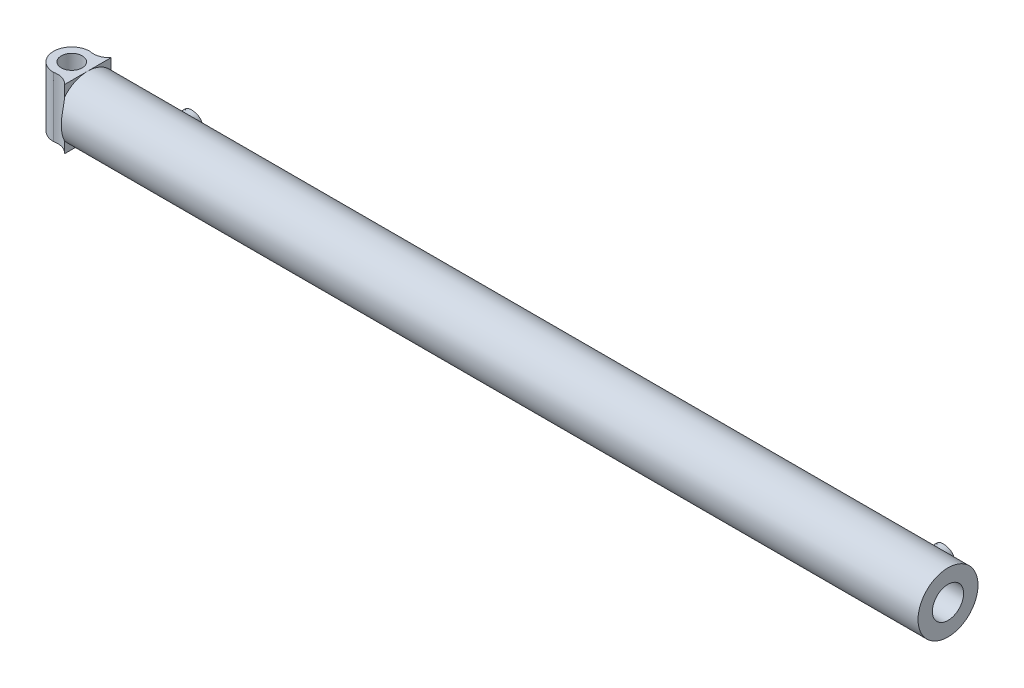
ISO-10303-21;
HEADER;
FILE_DESCRIPTION(('STEP AP214'),'2;1');
FILE_NAME('part.step','',(''),(''),'','','');
FILE_SCHEMA(('AUTOMOTIVE_DESIGN { 1 0 10303 214 1 1 1 1 }'));
ENDSEC;
DATA;
#1=APPLICATION_CONTEXT('core data for automotive mechanical design processes');
#2=APPLICATION_PROTOCOL_DEFINITION('international standard','automotive_design',2000,#1);
#3=PRODUCT_CONTEXT('',#1,'mechanical');
#4=PRODUCT('Part','Part','',(#3));
#5=PRODUCT_RELATED_PRODUCT_CATEGORY('part','',(#4));
#6=PRODUCT_DEFINITION_FORMATION('','',#4);
#7=PRODUCT_DEFINITION_CONTEXT('part definition',#1,'design');
#8=PRODUCT_DEFINITION('design','',#6,#7);
#9=PRODUCT_DEFINITION_SHAPE('','',#8);
#10=(LENGTH_UNIT() NAMED_UNIT(*) SI_UNIT(.MILLI.,.METRE.));
#11=(NAMED_UNIT(*) PLANE_ANGLE_UNIT() SI_UNIT($,.RADIAN.));
#12=(NAMED_UNIT(*) SI_UNIT($,.STERADIAN.) SOLID_ANGLE_UNIT());
#13=UNCERTAINTY_MEASURE_WITH_UNIT(LENGTH_MEASURE(1.E-05),#10,'distance_accuracy_value','');
#14=(GEOMETRIC_REPRESENTATION_CONTEXT(3) GLOBAL_UNCERTAINTY_ASSIGNED_CONTEXT((#13)) GLOBAL_UNIT_ASSIGNED_CONTEXT((#10,
#11,#12)) REPRESENTATION_CONTEXT('',''));
#15=CARTESIAN_POINT('',(0.,0.,0.));
#16=DIRECTION('',(0.,0.,1.));
#17=DIRECTION('',(1.,0.,0.));
#18=AXIS2_PLACEMENT_3D('',#15,#16,#17);
#19=CARTESIAN_POINT('',(-4.31799999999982,36.576,36.6576836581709));
#20=DIRECTION('',(1.,0.,0.));
#21=DIRECTION('',(0.,0.,-1.));
#22=AXIS2_PLACEMENT_3D('',#19,#20,#21);
#23=CYLINDRICAL_SURFACE('',#22,36.576);
#24=CARTESIAN_POINT('',(85.9789990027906,36.5712254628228,0.0816839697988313));
#25=CARTESIAN_POINT('',(85.9791276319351,36.8836420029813,0.0816421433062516));
#26=CARTESIAN_POINT('',(85.9660870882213,37.1960439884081,0.0856141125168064));
#27=CARTESIAN_POINT('',(85.9145057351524,37.8185525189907,0.101469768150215));
#28=CARTESIAN_POINT('',(85.875962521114,38.1286588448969,0.113354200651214));
#29=CARTESIAN_POINT('',(85.7740684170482,38.7444138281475,0.144715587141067));
#30=CARTESIAN_POINT('',(85.710713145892,39.0500616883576,0.164193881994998));
#31=CARTESIAN_POINT('',(85.5596948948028,39.6547542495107,0.210229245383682));
#32=CARTESIAN_POINT('',(85.4720347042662,39.9537997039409,0.236785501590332));
#33=CARTESIAN_POINT('',(85.3226419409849,40.3956726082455,0.281374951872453));
#34=CARTESIAN_POINT('',(85.2698682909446,40.5418299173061,0.297028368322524));
#35=CARTESIAN_POINT('',(85.1583320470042,40.8316832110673,0.329812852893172));
#36=CARTESIAN_POINT('',(85.0995694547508,40.9753791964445,0.346943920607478));
#37=CARTESIAN_POINT('',(84.9762491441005,41.2601097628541,0.382575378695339));
#38=CARTESIAN_POINT('',(84.911690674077,41.4011439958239,0.401075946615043));
#39=CARTESIAN_POINT('',(84.7769555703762,41.6803203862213,0.439324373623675));
#40=CARTESIAN_POINT('',(84.7067789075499,41.8184625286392,0.459072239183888));
#41=CARTESIAN_POINT('',(84.4882569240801,42.2278247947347,0.519938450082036));
#42=CARTESIAN_POINT('',(84.3317057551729,42.494473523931,0.562741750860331));
#43=CARTESIAN_POINT('',(83.9980038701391,43.0137640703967,0.65173447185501));
#44=CARTESIAN_POINT('',(83.8208608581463,43.2664110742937,0.697922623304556));
#45=CARTESIAN_POINT('',(83.480090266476,43.713032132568,0.784173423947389));
#46=CARTESIAN_POINT('',(83.3196114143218,43.9094815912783,0.823875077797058));
#47=CARTESIAN_POINT('',(83.0694617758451,44.1957180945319,0.884045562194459));
#48=CARTESIAN_POINT('',(82.9845071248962,44.289723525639,0.904205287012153));
#49=CARTESIAN_POINT('',(82.8114902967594,44.4748406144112,0.944645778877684));
#50=CARTESIAN_POINT('',(82.7234273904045,44.5659515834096,0.964926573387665));
#51=CARTESIAN_POINT('',(82.4083680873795,44.8812964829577,1.03635080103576));
#52=CARTESIAN_POINT('',(82.1734030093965,45.0976541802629,1.08760855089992));
#53=CARTESIAN_POINT('',(81.6859987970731,45.5101427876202,1.18896474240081));
#54=CARTESIAN_POINT('',(81.4335529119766,45.7062658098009,1.23906272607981));
#55=CARTESIAN_POINT('',(80.9122198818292,46.0771055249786,1.33673216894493));
#56=CARTESIAN_POINT('',(80.643303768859,46.2517827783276,1.38429888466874));
#57=CARTESIAN_POINT('',(80.0911618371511,46.5780777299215,1.47543054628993));
#58=CARTESIAN_POINT('',(79.8079371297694,46.7296972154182,1.51899580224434));
#59=CARTESIAN_POINT('',(79.3737621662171,46.9391235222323,1.58041557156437));
#60=CARTESIAN_POINT('',(79.2273850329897,47.0059684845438,1.60024547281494));
#61=CARTESIAN_POINT('',(78.9318017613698,47.1335377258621,1.63845178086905));
#62=CARTESIAN_POINT('',(78.7825956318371,47.1942620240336,1.65682819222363));
#63=CARTESIAN_POINT('',(78.331095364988,47.3669567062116,1.70952817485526));
#64=CARTESIAN_POINT('',(78.0248378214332,47.4694882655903,1.74143416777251));
#65=CARTESIAN_POINT('',(77.4043607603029,47.6483290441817,1.7977339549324));
#66=CARTESIAN_POINT('',(77.0901471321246,47.7246570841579,1.82213313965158));
#67=CARTESIAN_POINT('',(76.4558596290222,47.8504808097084,1.86265187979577));
#68=CARTESIAN_POINT('',(76.1357858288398,47.8999768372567,1.87877154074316));
#69=CARTESIAN_POINT('',(75.5026828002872,47.9704578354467,1.90179995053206));
#70=CARTESIAN_POINT('',(75.1897620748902,47.9923159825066,1.90899065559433));
#71=CARTESIAN_POINT('',(74.7198557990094,48.0058061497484,1.91342809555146));
#72=CARTESIAN_POINT('',(74.5631197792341,48.0070860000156,1.91384891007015));
#73=CARTESIAN_POINT('',(74.2497395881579,48.0031006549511,1.91253793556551));
#74=CARTESIAN_POINT('',(74.0930954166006,47.9978354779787,1.91080615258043));
#75=CARTESIAN_POINT('',(73.6237623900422,47.972328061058,1.90242691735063));
#76=CARTESIAN_POINT('',(73.3116023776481,47.9423759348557,1.89259623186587));
#77=CARTESIAN_POINT('',(72.6911328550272,47.8572117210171,1.86486802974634));
#78=CARTESIAN_POINT('',(72.3828236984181,47.8019973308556,1.8469697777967));
#79=CARTESIAN_POINT('',(71.7792208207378,47.668435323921,1.80418383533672));
#80=CARTESIAN_POINT('',(71.4837907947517,47.5906479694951,1.77946606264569));
#81=CARTESIAN_POINT('',(70.9006332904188,47.4119734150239,1.72354239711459));
#82=CARTESIAN_POINT('',(70.6129047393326,47.3110894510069,1.69233741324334));
#83=CARTESIAN_POINT('',(70.1886525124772,47.1427261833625,1.64123767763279));
#84=CARTESIAN_POINT('',(70.0484373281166,47.0837550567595,1.62348596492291));
#85=CARTESIAN_POINT('',(69.7706526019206,46.9602490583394,1.58667991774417));
#86=CARTESIAN_POINT('',(69.6330830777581,46.8957141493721,1.56762557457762));
#87=CARTESIAN_POINT('',(69.2245891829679,46.6940289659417,1.50873068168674));
#88=CARTESIAN_POINT('',(68.9578580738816,46.5487897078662,1.46715565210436));
#89=CARTESIAN_POINT('',(68.4290806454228,46.2332487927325,1.37923468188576));
#90=CARTESIAN_POINT('',(68.1674324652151,46.0623123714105,1.33278115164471));
#91=CARTESIAN_POINT('',(67.6591198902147,45.7000619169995,1.23748687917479));
#92=CARTESIAN_POINT('',(67.4124547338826,45.5087489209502,1.18864625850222));
#93=CARTESIAN_POINT('',(66.9356394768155,45.106676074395,1.08980184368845));
#94=CARTESIAN_POINT('',(66.7054937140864,44.8959111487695,1.03979774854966));
#95=CARTESIAN_POINT('',(66.2635209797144,44.4559468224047,0.939886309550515));
#96=CARTESIAN_POINT('',(66.0516946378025,44.2267467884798,0.88997896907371));
#97=CARTESIAN_POINT('',(65.6392320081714,43.7421118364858,0.789671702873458));
#98=CARTESIAN_POINT('',(65.4393831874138,43.4859939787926,0.739332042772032));
#99=CARTESIAN_POINT('',(65.0617732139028,42.9574096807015,0.641664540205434));
#100=CARTESIAN_POINT('',(64.8840134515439,42.6849422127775,0.594336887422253));
#101=CARTESIAN_POINT('',(64.551878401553,42.1252986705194,0.503992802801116));
#102=CARTESIAN_POINT('',(64.3975069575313,41.8381201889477,0.460977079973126));
#103=CARTESIAN_POINT('',(64.1846892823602,41.3978270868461,0.400605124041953));
#104=CARTESIAN_POINT('',(64.1168688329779,41.2494634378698,0.381171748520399));
#105=CARTESIAN_POINT('',(63.9876566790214,40.9497758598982,0.343820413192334));
#106=CARTESIAN_POINT('',(63.9262649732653,40.7984519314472,0.325902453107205));
#107=CARTESIAN_POINT('',(63.7532480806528,40.3441817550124,0.275042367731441));
#108=CARTESIAN_POINT('',(63.651034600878,40.0373156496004,0.244493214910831));
#109=CARTESIAN_POINT('',(63.472820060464,39.4154384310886,0.190728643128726));
#110=CARTESIAN_POINT('',(63.3968216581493,39.1004264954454,0.16751396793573));
#111=CARTESIAN_POINT('',(63.2717854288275,38.4649874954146,0.129109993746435));
#112=CARTESIAN_POINT('',(63.2227164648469,38.1445671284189,0.113911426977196));
#113=CARTESIAN_POINT('',(63.1519492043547,37.5004903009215,0.0919505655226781));
#114=CARTESIAN_POINT('',(63.1302427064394,37.176834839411,0.0851857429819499));
#115=CARTESIAN_POINT('',(63.117234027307,36.6418024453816,0.0811326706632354));
#116=CARTESIAN_POINT('',(63.1179727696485,36.4306012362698,0.0813636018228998));
#117=CARTESIAN_POINT('',(63.1311223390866,36.0086319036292,0.0854762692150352));
#118=CARTESIAN_POINT('',(63.143530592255,35.7978636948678,0.0893572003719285));
#119=CARTESIAN_POINT('',(63.179991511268,35.3774359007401,0.100722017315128));
#120=CARTESIAN_POINT('',(63.2040441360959,35.1677763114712,0.108205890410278));
#121=CARTESIAN_POINT('',(63.2636938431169,34.7502556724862,0.126681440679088));
#122=CARTESIAN_POINT('',(63.2992919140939,34.5423947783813,0.13767341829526));
#123=CARTESIAN_POINT('',(63.403188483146,34.0226162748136,0.169571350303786));
#124=CARTESIAN_POINT('',(63.4788846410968,33.7122825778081,0.19266710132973));
#125=CARTESIAN_POINT('',(63.6558125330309,33.0995266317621,0.245974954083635));
#126=CARTESIAN_POINT('',(63.7570504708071,32.7971063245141,0.276188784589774));
#127=CARTESIAN_POINT('',(63.9273595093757,32.350928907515,0.32622308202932));
#128=CARTESIAN_POINT('',(63.9872534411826,32.2033435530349,0.343700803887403));
#129=CARTESIAN_POINT('',(64.1131501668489,31.9109850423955,0.38009951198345));
#130=CARTESIAN_POINT('',(64.1791528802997,31.7662118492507,0.399020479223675));
#131=CARTESIAN_POINT('',(64.3860568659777,31.3364760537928,0.457756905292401));
#132=CARTESIAN_POINT('',(64.535882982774,31.0560213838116,0.499554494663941));
#133=CARTESIAN_POINT('',(64.85751072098,30.5096007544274,0.587210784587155));
#134=CARTESIAN_POINT('',(65.0292624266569,30.2436037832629,0.633060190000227));
#135=CARTESIAN_POINT('',(65.3937771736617,29.7269799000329,0.727700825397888));
#136=CARTESIAN_POINT('',(65.5865401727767,29.4763529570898,0.776492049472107));
#137=CARTESIAN_POINT('',(65.9919437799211,28.9920606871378,0.875722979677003));
#138=CARTESIAN_POINT('',(66.2045823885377,28.7583936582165,0.926162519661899));
#139=CARTESIAN_POINT('',(66.5376359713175,28.4219904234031,1.00198082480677));
#140=CARTESIAN_POINT('',(66.6510147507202,28.3121956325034,1.02728254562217));
#141=CARTESIAN_POINT('',(66.8822953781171,28.0974500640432,1.07777177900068));
#142=CARTESIAN_POINT('',(67.0001972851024,27.9924993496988,1.10295929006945));
#143=CARTESIAN_POINT('',(67.3662226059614,27.6800330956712,1.17934839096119));
#144=CARTESIAN_POINT('',(67.6212347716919,27.4803890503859,1.23012828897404));
#145=CARTESIAN_POINT('',(68.1474015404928,27.1029799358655,1.32917182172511));
#146=CARTESIAN_POINT('',(68.4185579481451,26.9252173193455,1.37743517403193));
#147=CARTESIAN_POINT('',(68.9754863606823,26.5927896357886,1.47005704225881));
#148=CARTESIAN_POINT('',(69.2612617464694,26.4381299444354,1.51441464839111));
#149=CARTESIAN_POINT('',(69.6994364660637,26.2247407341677,1.57690982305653));
#150=CARTESIAN_POINT('',(69.8470849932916,26.1567091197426,1.59706860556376));
#151=CARTESIAN_POINT('',(70.145384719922,26.0270709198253,1.63585543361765));
#152=CARTESIAN_POINT('',(70.2960358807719,25.9654642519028,1.65448349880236));
#153=CARTESIAN_POINT('',(70.5988836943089,25.8492614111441,1.68991963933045));
#154=CARTESIAN_POINT('',(70.7510595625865,25.7946149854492,1.70674060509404));
#155=CARTESIAN_POINT('',(71.0577539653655,25.6917957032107,1.7386235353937));
#156=CARTESIAN_POINT('',(71.2122725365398,25.6436229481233,1.75368547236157));
#157=CARTESIAN_POINT('',(71.678971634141,25.5088700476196,1.79608082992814));
#158=CARTESIAN_POINT('',(71.994297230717,25.4320546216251,1.82062399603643));
#159=CARTESIAN_POINT('',(72.6303499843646,25.3051117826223,1.86148733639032));
#160=CARTESIAN_POINT('',(72.9510703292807,25.2549529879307,1.87781717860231));
#161=CARTESIAN_POINT('',(73.595885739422,25.1818991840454,1.90168052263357));
#162=CARTESIAN_POINT('',(73.9199792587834,25.1589921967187,1.9092178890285));
#163=CARTESIAN_POINT('',(74.3510847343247,25.1472469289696,1.91308173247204));
#164=CARTESIAN_POINT('',(74.4578253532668,25.1458620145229,1.91353714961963));
#165=CARTESIAN_POINT('',(74.6712978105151,25.1461603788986,1.91343884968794));
#166=CARTESIAN_POINT('',(74.7780296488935,25.1478434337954,1.91288520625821));
#167=CARTESIAN_POINT('',(75.0980453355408,25.1573927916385,1.90974500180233));
#168=CARTESIAN_POINT('',(75.3111949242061,25.1697580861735,1.90567956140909));
#169=CARTESIAN_POINT('',(75.736371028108,25.2062231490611,1.89373222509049));
#170=CARTESIAN_POINT('',(75.9483975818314,25.2303225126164,1.88585046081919));
#171=CARTESIAN_POINT('',(76.2650534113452,25.2752421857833,1.87123673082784));
#172=CARTESIAN_POINT('',(76.3703854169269,25.2916793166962,1.86589961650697));
#173=CARTESIAN_POINT('',(76.5804915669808,25.3275188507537,1.85429584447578));
#174=CARTESIAN_POINT('',(76.6852657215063,25.3469212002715,1.84802920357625));
#175=CARTESIAN_POINT('',(76.9462692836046,25.399055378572,1.83124588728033));
#176=CARTESIAN_POINT('',(77.1021028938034,25.4336093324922,1.8201682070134));
#177=CARTESIAN_POINT('',(77.4120143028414,25.5091372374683,1.79610179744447));
#178=CARTESIAN_POINT('',(77.566092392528,25.5501101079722,1.78311338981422));
#179=CARTESIAN_POINT('',(78.0254052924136,25.6826751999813,1.74138544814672));
#180=CARTESIAN_POINT('',(78.3276723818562,25.7839046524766,1.7098862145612));
#181=CARTESIAN_POINT('',(78.9223834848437,26.0109701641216,1.64057341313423));
#182=CARTESIAN_POINT('',(79.2148164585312,26.136832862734,1.60275301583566));
#183=CARTESIAN_POINT('',(79.7876226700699,26.4121591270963,1.52193710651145));
#184=CARTESIAN_POINT('',(80.0679956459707,26.561623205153,1.47894148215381));
#185=CARTESIAN_POINT('',(80.6142646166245,26.8827103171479,1.38911938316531));
#186=CARTESIAN_POINT('',(80.8801906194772,27.0542847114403,1.34230139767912));
#187=CARTESIAN_POINT('',(81.3965846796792,27.4186425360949,1.24607428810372));
#188=CARTESIAN_POINT('',(81.6470523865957,27.611426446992,1.19666510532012));
#189=CARTESIAN_POINT('',(82.1310278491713,28.0169103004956,1.09661881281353));
#190=CARTESIAN_POINT('',(82.364538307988,28.2296070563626,1.04598190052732));
#191=CARTESIAN_POINT('',(82.7009533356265,28.5625590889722,0.970129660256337));
#192=CARTESIAN_POINT('',(82.8107931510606,28.6758725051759,0.944860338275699));
#193=CARTESIAN_POINT('',(83.0256751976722,28.9070071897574,0.894513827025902));
#194=CARTESIAN_POINT('',(83.1307172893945,29.0248285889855,0.869436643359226));
#195=CARTESIAN_POINT('',(83.4438142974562,29.3910199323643,0.793453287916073));
#196=CARTESIAN_POINT('',(83.6439866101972,29.6463319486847,0.743128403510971));
#197=CARTESIAN_POINT('',(84.022255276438,30.173331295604,0.645443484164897));
#198=CARTESIAN_POINT('',(84.2003503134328,30.445019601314,0.598083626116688));
#199=CARTESIAN_POINT('',(84.5331978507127,31.0031181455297,0.507625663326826));
#200=CARTESIAN_POINT('',(84.687944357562,31.2895321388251,0.464528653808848));
#201=CARTESIAN_POINT('',(84.9726713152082,31.8752046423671,0.383813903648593));
#202=CARTESIAN_POINT('',(85.1026532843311,32.1744623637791,0.346195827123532));
#203=CARTESIAN_POINT('',(85.2816177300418,32.6413758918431,0.293563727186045));
#204=CARTESIAN_POINT('',(85.3400709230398,32.8051942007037,0.276200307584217));
#205=CARTESIAN_POINT('',(85.4494717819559,33.1354677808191,0.243482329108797));
#206=CARTESIAN_POINT('',(85.5004212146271,33.3019224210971,0.228127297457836));
#207=CARTESIAN_POINT('',(85.641965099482,33.8048544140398,0.185261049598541));
#208=CARTESIAN_POINT('',(85.7212449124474,34.1448730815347,0.160951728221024));
#209=CARTESIAN_POINT('',(85.848892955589,34.8310162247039,0.121716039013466));
#210=CARTESIAN_POINT('',(85.8972722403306,35.1771384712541,0.106786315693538));
#211=CARTESIAN_POINT('',(85.9622483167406,35.8725890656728,0.0867952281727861));
#212=CARTESIAN_POINT('',(85.9788551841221,36.2219163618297,0.0817307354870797));
#213=CARTESIAN_POINT('',(85.9789990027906,36.5712254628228,0.0816839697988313));
#214=B_SPLINE_CURVE_WITH_KNOTS('',3,(#24,#25,#26,#27,#28,#29,#30,#31,#32,#33,#34,#35,#36,#37,
#38,#39,#40,#41,#42,#43,#44,#45,#46,#47,#48,#49,#50,#51,#52,#53,#54,#55,#56,#57,#58,#59,#60,#61,
#62,#63,#64,#65,#66,#67,#68,#69,#70,#71,#72,#73,#74,#75,#76,#77,#78,#79,#80,#81,#82,#83,#84,#85,
#86,#87,#88,#89,#90,#91,#92,#93,#94,#95,#96,#97,#98,#99,#100,#101,#102,#103,#104,#105,#106,#107,
#108,#109,#110,#111,#112,#113,#114,#115,#116,#117,#118,#119,#120,#121,#122,#123,#124,#125,#126,
#127,#128,#129,#130,#131,#132,#133,#134,#135,#136,#137,#138,#139,#140,#141,#142,#143,#144,#145,
#146,#147,#148,#149,#150,#151,#152,#153,#154,#155,#156,#157,#158,#159,#160,#161,#162,#163,#164,
#165,#166,#167,#168,#169,#170,#171,#172,#173,#174,#175,#176,#177,#178,#179,#180,#181,#182,#183,
#184,#185,#186,#187,#188,#189,#190,#191,#192,#193,#194,#195,#196,#197,#198,#199,#200,#201,#202,
#203,#204,#205,#206,#207,#208,#209,#210,#211,#212,#213),.UNSPECIFIED.,.T.,.F.,(4,2,2,2,2,2,2,2,
2,2,2,2,2,2,2,2,2,2,2,2,2,2,2,2,2,2,2,2,2,2,2,2,2,2,2,2,2,2,2,2,2,2,2,2,2,2,2,2,2,2,2,2,2,2,2,2,
2,2,2,2,2,2,2,2,2,2,2,2,2,2,2,2,2,2,2,2,2,2,2,2,2,2,2,2,2,2,2,2,2,2,2,2,2,2,4),(0.,
0.936932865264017,1.87395408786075,2.81114083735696,3.74822007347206,4.21664307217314,
4.68506594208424,5.1535496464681,5.6220357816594,6.55739062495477,7.49239663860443,
8.26207308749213,8.64690740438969,9.03183260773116,10.0010949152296,10.9707336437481,
11.9421296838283,12.913450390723,13.3997281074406,13.8860043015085,14.8582837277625,
15.8298633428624,16.8014305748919,17.7414661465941,18.2115621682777,18.681656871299,
19.6216349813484,20.5616987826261,21.4801781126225,22.398528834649,22.8578469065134,
23.317168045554,24.2357409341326,25.1826413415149,26.1294935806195,27.0765935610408,
28.0237260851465,29.0087756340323,29.9938871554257,30.979160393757,31.4718724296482,
31.9645843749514,32.9378950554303,33.9113044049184,34.8835858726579,35.8555758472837,
36.4888607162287,37.1220059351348,37.7551489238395,38.3883461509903,39.3478884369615,
40.3076640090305,40.7882319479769,41.268793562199,42.2296726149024,43.1884018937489,
44.1471292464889,45.105760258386,45.5851684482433,46.0645828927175,47.0467976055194,
48.0291223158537,49.0116752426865,49.5029840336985,49.9942865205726,50.4818120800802,
50.9693452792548,51.9444062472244,52.9183167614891,53.8917990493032,54.2120171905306,
54.5322119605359,55.1724649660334,55.8126958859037,56.1328770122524,56.4530523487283,
56.9328932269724,57.4126534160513,58.372315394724,59.3330209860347,60.29374743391,
61.2523953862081,62.2110650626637,63.1695815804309,63.6489322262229,64.1282967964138,
65.1119593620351,66.0956805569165,67.0796538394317,68.063566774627,68.5877877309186,
69.1118850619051,70.1601658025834,71.2080713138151,72.2556444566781),.UNSPECIFIED.);
#215=CARTESIAN_POINT('',(85.9789990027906,36.5712254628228,0.0816839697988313));
#216=VERTEX_POINT('',#215);
#217=EDGE_CURVE('E49',#216,#216,#214,.T.);
#218=ORIENTED_EDGE('',*,*,#217,.T.);
#219=EDGE_LOOP('',(#218));
#220=FACE_BOUND('',#219,.T.);
#221=CARTESIAN_POINT('',(1044.702,36.576,36.6576836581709));
#222=DIRECTION('',(1.,0.,0.));
#223=DIRECTION('',(0.,0.,-1.));
#224=AXIS2_PLACEMENT_3D('',#221,#222,#223);
#225=CIRCLE('',#224,36.576);
#226=CARTESIAN_POINT('',(1044.702,36.576,0.0816836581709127));
#227=VERTEX_POINT('',#226);
#228=EDGE_CURVE('E106',#227,#227,#225,.T.);
#229=ORIENTED_EDGE('',*,*,#228,.F.);
#230=EDGE_LOOP('',(#229));
#231=FACE_BOUND('',#230,.T.);
#232=CARTESIAN_POINT('',(-4.31799999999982,13.498729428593,8.28087342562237));
#233=CARTESIAN_POINT('',(-4.14841799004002,13.7366402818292,8.08737175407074));
#234=CARTESIAN_POINT('',(-3.98600358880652,13.9800442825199,7.89441743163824));
#235=CARTESIAN_POINT('',(-3.67496537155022,14.4771205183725,7.5107883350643));
#236=CARTESIAN_POINT('',(-3.52633797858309,14.7307900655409,7.32011298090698));
#237=CARTESIAN_POINT('',(-3.24250630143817,15.2473219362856,6.94247710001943));
#238=CARTESIAN_POINT('',(-3.10727751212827,15.5101662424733,6.75551031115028));
#239=CARTESIAN_POINT('',(-2.84925658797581,16.0448383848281,6.38590018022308));
#240=CARTESIAN_POINT('',(-2.72646527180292,16.3166668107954,6.20325712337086));
#241=CARTESIAN_POINT('',(-2.37762232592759,17.1401203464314,5.66612084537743));
#242=CARTESIAN_POINT('',(-2.16873753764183,17.7040842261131,5.31921176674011));
#243=CARTESIAN_POINT('',(-1.79123154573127,18.8604017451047,4.65131423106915));
#244=CARTESIAN_POINT('',(-1.62263377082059,19.4527716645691,4.33034092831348));
#245=CARTESIAN_POINT('',(-1.37568940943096,20.439096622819,3.83105148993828));
#246=CARTESIAN_POINT('',(-1.28694907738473,20.8259420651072,3.64366766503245));
#247=CARTESIAN_POINT('',(-1.12191376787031,21.6082268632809,3.28171578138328));
#248=CARTESIAN_POINT('',(-1.0456194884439,22.0036666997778,3.10714844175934));
#249=CARTESIAN_POINT('',(-0.904174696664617,22.8021848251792,2.7715006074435));
#250=CARTESIAN_POINT('',(-0.839024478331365,23.2052633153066,2.61042046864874));
#251=CARTESIAN_POINT('',(-0.718646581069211,24.0182380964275,2.30225636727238));
#252=CARTESIAN_POINT('',(-0.663419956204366,24.4281351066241,2.1551738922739));
#253=CARTESIAN_POINT('',(-0.561632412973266,25.2551348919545,1.87503038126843));
#254=CARTESIAN_POINT('',(-0.515097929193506,25.6722555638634,1.74201263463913));
#255=CARTESIAN_POINT('',(-0.429882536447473,26.5117775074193,1.49083569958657));
#256=CARTESIAN_POINT('',(-0.391202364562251,26.9341792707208,1.37267790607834));
#257=CARTESIAN_POINT('',(-0.320807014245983,27.7834413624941,1.15152639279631));
#258=CARTESIAN_POINT('',(-0.289090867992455,28.2103010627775,1.04853056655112));
#259=CARTESIAN_POINT('',(-0.231832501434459,29.0678799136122,0.85789491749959));
#260=CARTESIAN_POINT('',(-0.206290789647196,29.4985993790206,0.77025635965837));
#261=CARTESIAN_POINT('',(-0.160358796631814,30.3700558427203,0.609251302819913));
#262=CARTESIAN_POINT('',(-0.140056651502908,30.8108433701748,0.536133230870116));
#263=CARTESIAN_POINT('',(-0.104570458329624,31.6950038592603,0.406072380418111));
#264=CARTESIAN_POINT('',(-0.0893864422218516,32.1383768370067,0.349129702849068));
#265=CARTESIAN_POINT('',(-0.0636924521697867,33.0270579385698,0.251521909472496));
#266=CARTESIAN_POINT('',(-0.0531826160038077,33.4723661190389,0.210857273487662));
#267=CARTESIAN_POINT('',(-0.0365215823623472,34.3642228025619,0.145881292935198));
#268=CARTESIAN_POINT('',(-0.0303700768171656,34.8107712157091,0.121568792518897));
#269=CARTESIAN_POINT('',(-0.0222338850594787,35.7046571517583,0.0893281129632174));
#270=CARTESIAN_POINT('',(-0.0202506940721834,36.1519949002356,0.08140581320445));
#271=CARTESIAN_POINT('',(-0.0203939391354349,37.0466254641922,0.0819763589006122));
#272=CARTESIAN_POINT('',(-0.0225200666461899,37.4939182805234,0.0904679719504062));
#273=CARTESIAN_POINT('',(-0.0309478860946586,38.3879124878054,0.123851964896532));
#274=CARTESIAN_POINT('',(-0.0372501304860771,38.8346137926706,0.148746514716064));
#275=CARTESIAN_POINT('',(-0.0542243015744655,39.7266871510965,0.214893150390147));
#276=CARTESIAN_POINT('',(-0.0648959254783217,40.1720592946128,0.25614410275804));
#277=CARTESIAN_POINT('',(-0.0923899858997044,41.1107467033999,0.360477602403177));
#278=CARTESIAN_POINT('',(-0.109768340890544,41.6038325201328,0.425490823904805));
#279=CARTESIAN_POINT('',(-0.150952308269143,42.5866911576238,0.575520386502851));
#280=CARTESIAN_POINT('',(-0.174758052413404,43.0764639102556,0.660537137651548));
#281=CARTESIAN_POINT('',(-0.229622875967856,44.0518196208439,0.850383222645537));
#282=CARTESIAN_POINT('',(-0.260682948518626,44.5374019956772,0.955215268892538));
#283=CARTESIAN_POINT('',(-0.331070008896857,45.5033301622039,1.1844129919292));
#284=CARTESIAN_POINT('',(-0.370396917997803,45.9836760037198,1.30877848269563));
#285=CARTESIAN_POINT('',(-0.458383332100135,46.9365749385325,1.57625899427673));
#286=CARTESIAN_POINT('',(-0.507012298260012,47.4091481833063,1.71931218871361));
#287=CARTESIAN_POINT('',(-0.61506796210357,48.3470237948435,2.02403120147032));
#288=CARTESIAN_POINT('',(-0.67449485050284,48.812326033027,2.18569734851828));
#289=CARTESIAN_POINT('',(-0.805703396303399,49.734468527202,2.52704965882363));
#290=CARTESIAN_POINT('',(-0.877484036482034,50.1913094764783,2.70673433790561));
#291=CARTESIAN_POINT('',(-1.03513475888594,51.0953242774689,3.08339704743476));
#292=CARTESIAN_POINT('',(-1.12100396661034,51.5424987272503,3.28037400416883));
#293=CARTESIAN_POINT('',(-1.29037185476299,52.3395150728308,3.65057951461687));
#294=CARTESIAN_POINT('',(-1.3710537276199,52.6912985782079,3.82092526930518));
#295=CARTESIAN_POINT('',(-1.54380337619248,53.3870005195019,4.17159817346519));
#296=CARTESIAN_POINT('',(-1.63587054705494,53.7309193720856,4.35192479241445));
#297=CARTESIAN_POINT('',(-1.83241479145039,54.4098945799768,4.72172708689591));
#298=CARTESIAN_POINT('',(-1.93688392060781,54.7449564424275,4.91119685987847));
#299=CARTESIAN_POINT('',(-2.15936888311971,55.4055547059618,5.29850290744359));
#300=CARTESIAN_POINT('',(-2.27738265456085,55.7310925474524,5.49633790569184));
#301=CARTESIAN_POINT('',(-2.52930894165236,56.3749535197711,5.90136301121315));
#302=CARTESIAN_POINT('',(-2.66336615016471,56.6931744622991,6.10862588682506));
#303=CARTESIAN_POINT('',(-2.94753426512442,57.3180648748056,6.52941728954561));
#304=CARTESIAN_POINT('',(-3.09764360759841,57.624735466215,6.74294520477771));
#305=CARTESIAN_POINT('',(-3.41540080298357,58.2263610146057,7.17543343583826));
#306=CARTESIAN_POINT('',(-3.5830936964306,58.5212830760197,7.39440654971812));
#307=CARTESIAN_POINT('',(-3.93667643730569,59.0976629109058,7.83562854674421));
#308=CARTESIAN_POINT('',(-4.1225733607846,59.3791153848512,8.0578786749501));
#309=CARTESIAN_POINT('',(-4.31799999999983,59.653270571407,8.28087342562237));
#310=B_SPLINE_CURVE_WITH_KNOTS('',3,(#232,#233,#234,#235,#236,#237,#238,#239,#240,#241,#242,
#243,#244,#245,#246,#247,#248,#249,#250,#251,#252,#253,#254,#255,#256,#257,#258,#259,#260,#261,
#262,#263,#264,#265,#266,#267,#268,#269,#270,#271,#272,#273,#274,#275,#276,#277,#278,#279,#280,
#281,#282,#283,#284,#285,#286,#287,#288,#289,#290,#291,#292,#293,#294,#295,#296,#297,#298,#299,
#300,#301,#302,#303,#304,#305,#306,#307,#308,#309),.UNSPECIFIED.,.F.,.F.,(4,2,2,2,2,2,2,2,2,2,2,
2,2,2,2,2,2,2,2,2,2,2,2,2,2,2,2,2,2,2,2,2,2,2,2,2,2,2,4),(0.,1.05111814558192,2.10196281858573,
3.1508486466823,4.19980347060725,6.28003144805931,8.36146624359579,9.67776471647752,
10.9941369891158,12.3105439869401,13.6270907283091,14.9475783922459,16.2681899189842,
17.5886177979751,18.9091543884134,20.2506368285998,21.5921276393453,22.9336579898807,
24.2750935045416,25.617010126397,26.958825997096,28.300819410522,29.6427198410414,
31.1352317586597,32.6277742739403,34.1205212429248,35.6132539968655,37.1011676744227,
38.5891076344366,40.0769251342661,41.5646503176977,42.7616061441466,43.9584984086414,
45.1546280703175,46.3505758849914,47.5582632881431,48.7658331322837,49.9765754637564,
51.1877903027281),.UNSPECIFIED.);
#311=CARTESIAN_POINT('',(-4.31799999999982,13.498729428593,8.28087342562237));
#312=VERTEX_POINT('',#311);
#313=CARTESIAN_POINT('',(-4.31799999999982,59.653270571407,8.28087342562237));
#314=VERTEX_POINT('',#313);
#315=EDGE_CURVE('E169',#312,#314,#310,.T.);
#316=ORIENTED_EDGE('',*,*,#315,.T.);
#317=CARTESIAN_POINT('',(-4.31799999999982,36.576,36.6576836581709));
#318=DIRECTION('',(1.,0.,0.));
#319=DIRECTION('',(0.,0.,-1.));
#320=AXIS2_PLACEMENT_3D('',#317,#318,#319);
#321=CIRCLE('',#320,36.576);
#322=CARTESIAN_POINT('',(-4.31799999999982,73.152,36.6576836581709));
#323=VERTEX_POINT('',#322);
#324=EDGE_CURVE('E166',#314,#323,#321,.T.);
#325=ORIENTED_EDGE('',*,*,#324,.T.);
#326=CARTESIAN_POINT('',(-4.31799999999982,59.653270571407,65.0344938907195));
#327=VERTEX_POINT('',#326);
#328=EDGE_CURVE('E170',#323,#327,#321,.T.);
#329=ORIENTED_EDGE('',*,*,#328,.T.);
#330=CARTESIAN_POINT('',(-4.31799999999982,13.498729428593,65.0344938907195));
#331=CARTESIAN_POINT('',(-4.14841799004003,13.7366402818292,65.2279955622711));
#332=CARTESIAN_POINT('',(-3.98600358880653,13.9800442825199,65.4209498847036));
#333=CARTESIAN_POINT('',(-3.67496537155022,14.4771205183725,65.8045789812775));
#334=CARTESIAN_POINT('',(-3.5263379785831,14.7307900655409,65.9952543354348));
#335=CARTESIAN_POINT('',(-3.24250630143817,15.2473219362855,66.3728902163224));
#336=CARTESIAN_POINT('',(-3.10727751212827,15.5101662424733,66.5598570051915));
#337=CARTESIAN_POINT('',(-2.8492565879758,16.0448383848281,66.9294671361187));
#338=CARTESIAN_POINT('',(-2.72646527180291,16.3166668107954,67.1121101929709));
#339=CARTESIAN_POINT('',(-2.37762232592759,17.1401203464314,67.6492464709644));
#340=CARTESIAN_POINT('',(-2.16873753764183,17.7040842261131,67.9961555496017));
#341=CARTESIAN_POINT('',(-1.79123154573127,18.8604017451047,68.6640530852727));
#342=CARTESIAN_POINT('',(-1.62263377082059,19.4527716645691,68.9850263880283));
#343=CARTESIAN_POINT('',(-1.37568940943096,20.439096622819,69.4843158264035));
#344=CARTESIAN_POINT('',(-1.28694907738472,20.8259420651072,69.6716996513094));
#345=CARTESIAN_POINT('',(-1.1219137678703,21.6082268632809,70.0336515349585));
#346=CARTESIAN_POINT('',(-1.0456194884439,22.0036666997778,70.2082188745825));
#347=CARTESIAN_POINT('',(-0.904174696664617,22.8021848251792,70.5438667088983));
#348=CARTESIAN_POINT('',(-0.839024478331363,23.2052633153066,70.7049468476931));
#349=CARTESIAN_POINT('',(-0.718646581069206,24.0182380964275,71.0131109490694));
#350=CARTESIAN_POINT('',(-0.663419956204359,24.4281351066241,71.1601934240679));
#351=CARTESIAN_POINT('',(-0.561632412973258,25.2551348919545,71.4403369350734));
#352=CARTESIAN_POINT('',(-0.515097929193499,25.6722555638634,71.5733546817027));
#353=CARTESIAN_POINT('',(-0.429882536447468,26.5117775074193,71.8245316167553));
#354=CARTESIAN_POINT('',(-0.391202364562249,26.9341792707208,71.9426894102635));
#355=CARTESIAN_POINT('',(-0.320807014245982,27.7834413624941,72.1638409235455));
#356=CARTESIAN_POINT('',(-0.289090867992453,28.2103010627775,72.2668367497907));
#357=CARTESIAN_POINT('',(-0.231832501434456,29.0678799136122,72.4574723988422));
#358=CARTESIAN_POINT('',(-0.206290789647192,29.4985993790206,72.5451109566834));
#359=CARTESIAN_POINT('',(-0.16035879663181,30.3700558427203,72.7061160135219));
#360=CARTESIAN_POINT('',(-0.140056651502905,30.8108433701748,72.7792340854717));
#361=CARTESIAN_POINT('',(-0.104570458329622,31.6950038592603,72.9092949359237));
#362=CARTESIAN_POINT('',(-0.0893864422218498,32.1383768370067,72.9662376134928));
#363=CARTESIAN_POINT('',(-0.0636924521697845,33.0270579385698,73.0638454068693));
#364=CARTESIAN_POINT('',(-0.0531826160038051,33.4723661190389,73.1045100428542));
#365=CARTESIAN_POINT('',(-0.0365215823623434,34.3642228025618,73.1694860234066));
#366=CARTESIAN_POINT('',(-0.0303700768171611,34.8107712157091,73.1937985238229));
#367=CARTESIAN_POINT('',(-0.0222338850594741,35.7046571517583,73.2260392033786));
#368=CARTESIAN_POINT('',(-0.0202506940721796,36.1519949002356,73.2339615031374));
#369=CARTESIAN_POINT('',(-0.0203939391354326,37.0466254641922,73.2333909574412));
#370=CARTESIAN_POINT('',(-0.0225200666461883,37.4939182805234,73.2248993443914));
#371=CARTESIAN_POINT('',(-0.0309478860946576,38.3879124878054,73.1915153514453));
#372=CARTESIAN_POINT('',(-0.037250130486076,38.8346137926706,73.1666208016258));
#373=CARTESIAN_POINT('',(-0.0542243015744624,39.7266871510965,73.1004741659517));
#374=CARTESIAN_POINT('',(-0.0648959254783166,40.1720592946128,73.0592232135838));
#375=CARTESIAN_POINT('',(-0.0923899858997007,41.1107467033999,72.9548897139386));
#376=CARTESIAN_POINT('',(-0.109768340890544,41.6038325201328,72.889876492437));
#377=CARTESIAN_POINT('',(-0.150952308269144,42.5866911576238,72.739846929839));
#378=CARTESIAN_POINT('',(-0.174758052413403,43.0764639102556,72.6548301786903));
#379=CARTESIAN_POINT('',(-0.22962287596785,44.0518196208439,72.4649840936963));
#380=CARTESIAN_POINT('',(-0.260682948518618,44.5374019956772,72.3601520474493));
#381=CARTESIAN_POINT('',(-0.331070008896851,45.5033301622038,72.1309543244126));
#382=CARTESIAN_POINT('',(-0.370396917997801,45.9836760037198,72.0065888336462));
#383=CARTESIAN_POINT('',(-0.458383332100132,46.9365749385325,71.7391083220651));
#384=CARTESIAN_POINT('',(-0.507012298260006,47.4091481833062,71.5960551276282));
#385=CARTESIAN_POINT('',(-0.615067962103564,48.3470237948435,71.2913361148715));
#386=CARTESIAN_POINT('',(-0.674494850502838,48.812326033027,71.1296699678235));
#387=CARTESIAN_POINT('',(-0.805703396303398,49.734468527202,70.7883176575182));
#388=CARTESIAN_POINT('',(-0.87748403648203,50.1913094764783,70.6086329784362));
#389=CARTESIAN_POINT('',(-1.03513475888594,51.0953242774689,70.231970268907));
#390=CARTESIAN_POINT('',(-1.12100396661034,51.5424987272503,70.034993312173));
#391=CARTESIAN_POINT('',(-1.29037185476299,52.3395150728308,69.664787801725));
#392=CARTESIAN_POINT('',(-1.3710537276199,52.6912985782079,69.4944420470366));
#393=CARTESIAN_POINT('',(-1.54380337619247,53.3870005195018,69.1437691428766));
#394=CARTESIAN_POINT('',(-1.63587054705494,53.7309193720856,68.9634425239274));
#395=CARTESIAN_POINT('',(-1.83241479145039,54.4098945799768,68.5936402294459));
#396=CARTESIAN_POINT('',(-1.93688392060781,54.7449564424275,68.4041704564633));
#397=CARTESIAN_POINT('',(-2.15936888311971,55.4055547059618,68.0168644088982));
#398=CARTESIAN_POINT('',(-2.27738265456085,55.7310925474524,67.81902941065));
#399=CARTESIAN_POINT('',(-2.52930894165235,56.3749535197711,67.4140043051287));
#400=CARTESIAN_POINT('',(-2.6633661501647,56.6931744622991,67.2067414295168));
#401=CARTESIAN_POINT('',(-2.94753426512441,57.3180648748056,66.7859500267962));
#402=CARTESIAN_POINT('',(-3.09764360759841,57.624735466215,66.5724221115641));
#403=CARTESIAN_POINT('',(-3.41540080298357,58.2263610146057,66.1399338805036));
#404=CARTESIAN_POINT('',(-3.5830936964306,58.5212830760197,65.9209607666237));
#405=CARTESIAN_POINT('',(-3.93667643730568,59.0976629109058,65.4797387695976));
#406=CARTESIAN_POINT('',(-4.12257336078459,59.3791153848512,65.2574886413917));
#407=CARTESIAN_POINT('',(-4.31799999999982,59.653270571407,65.0344938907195));
#408=B_SPLINE_CURVE_WITH_KNOTS('',3,(#330,#331,#332,#333,#334,#335,#336,#337,#338,#339,#340,
#341,#342,#343,#344,#345,#346,#347,#348,#349,#350,#351,#352,#353,#354,#355,#356,#357,#358,#359,
#360,#361,#362,#363,#364,#365,#366,#367,#368,#369,#370,#371,#372,#373,#374,#375,#376,#377,#378,
#379,#380,#381,#382,#383,#384,#385,#386,#387,#388,#389,#390,#391,#392,#393,#394,#395,#396,#397,
#398,#399,#400,#401,#402,#403,#404,#405,#406,#407),.UNSPECIFIED.,.F.,.F.,(4,2,2,2,2,2,2,2,2,2,2,
2,2,2,2,2,2,2,2,2,2,2,2,2,2,2,2,2,2,2,2,2,2,2,2,2,2,2,4),(0.,1.05111814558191,2.10196281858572,
3.15084864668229,4.19980347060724,6.28003144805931,8.36146624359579,9.67776471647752,
10.9941369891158,12.3105439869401,13.6270907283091,14.9475783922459,16.2681899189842,
17.5886177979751,18.9091543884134,20.2506368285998,21.5921276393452,22.9336579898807,
24.2750935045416,25.617010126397,26.958825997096,28.300819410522,29.6427198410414,
31.1352317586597,32.6277742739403,34.1205212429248,35.6132539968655,37.1011676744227,
38.5891076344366,40.0769251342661,41.5646503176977,42.7616061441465,43.9584984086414,
45.1546280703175,46.3505758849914,47.5582632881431,48.7658331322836,49.9765754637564,
51.1877903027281),.UNSPECIFIED.);
#409=CARTESIAN_POINT('',(-4.31799999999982,13.498729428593,65.0344938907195));
#410=VERTEX_POINT('',#409);
#411=EDGE_CURVE('E176',#410,#327,#408,.T.);
#412=ORIENTED_EDGE('',*,*,#411,.F.);
#413=CARTESIAN_POINT('',(-4.31799999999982,0.,36.6576836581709));
#414=VERTEX_POINT('',#413);
#415=EDGE_CURVE('E398',#410,#414,#321,.T.);
#416=ORIENTED_EDGE('',*,*,#415,.T.);
#417=EDGE_CURVE('E162',#414,#312,#321,.T.);
#418=ORIENTED_EDGE('',*,*,#417,.T.);
#419=EDGE_LOOP('',(#316,#325,#329,#412,#416,#418));
#420=FACE_BOUND('',#419,.T.);
#421=CARTESIAN_POINT('',(1002.79199900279,36.5712254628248,0.08168396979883));
#422=CARTESIAN_POINT('',(1002.79212763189,36.8836418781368,0.0816421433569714));
#423=CARTESIAN_POINT('',(1002.77908709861,37.1960437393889,0.0856141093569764));
#424=CARTESIAN_POINT('',(1002.72750578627,37.8185520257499,0.101469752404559));
#425=CARTESIAN_POINT('',(1002.68896260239,38.128658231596,0.113354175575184));
#426=CARTESIAN_POINT('',(1002.58706853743,38.7444132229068,0.14471555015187));
#427=CARTESIAN_POINT('',(1002.52371325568,39.050061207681,0.164193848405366));
#428=CARTESIAN_POINT('',(1002.37269496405,39.6547540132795,0.210229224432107));
#429=CARTESIAN_POINT('',(1002.2850347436,39.9537995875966,0.236785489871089));
#430=CARTESIAN_POINT('',(1002.13564193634,40.3956726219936,0.281374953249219));
#431=CARTESIAN_POINT('',(1002.0828682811,40.5418299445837,0.297028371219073));
#432=CARTESIAN_POINT('',(1001.97133202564,40.831683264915,0.329812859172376));
#433=CARTESIAN_POINT('',(1001.91256942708,40.9753792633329,0.346943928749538));
#434=CARTESIAN_POINT('',(1001.78924910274,41.2601098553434,0.38257539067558));
#435=CARTESIAN_POINT('',(1001.72469062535,41.4011441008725,0.401075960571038));
#436=CARTESIAN_POINT('',(1001.58995550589,41.6803205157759,0.439324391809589));
#437=CARTESIAN_POINT('',(1001.51977883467,41.8184626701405,0.459072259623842));
#438=CARTESIAN_POINT('',(1001.30125685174,42.2278249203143,0.519938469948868));
#439=CARTESIAN_POINT('',(1001.14470569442,42.4944736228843,0.562741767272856));
#440=CARTESIAN_POINT('',(1000.81100383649,43.0137641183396,0.651734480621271));
#441=CARTESIAN_POINT('',(1000.63386084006,43.2664110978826,0.697922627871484));
#442=CARTESIAN_POINT('',(1000.29309134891,43.7130307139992,0.784173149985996));
#443=CARTESIAN_POINT('',(1000.13261367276,43.9094788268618,0.823874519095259));
#444=CARTESIAN_POINT('',(999.882465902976,44.1957134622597,0.884044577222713));
#445=CARTESIAN_POINT('',(999.797511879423,44.2897183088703,0.904204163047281));
#446=CARTESIAN_POINT('',(999.624496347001,44.4748342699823,0.944644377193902));
#447=CARTESIAN_POINT('',(999.536434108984,44.565944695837,0.964925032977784));
#448=CARTESIAN_POINT('',(999.221376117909,44.8812888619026,1.03634902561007));
#449=CARTESIAN_POINT('',(998.986411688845,45.0976463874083,1.08760668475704));
#450=CARTESIAN_POINT('',(998.499008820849,45.5101347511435,1.18896271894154));
#451=CARTESIAN_POINT('',(998.246563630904,45.7062577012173,1.23906063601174));
#452=CARTESIAN_POINT('',(997.72523100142,46.0770981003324,1.3367301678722));
#453=CARTESIAN_POINT('',(997.456314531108,46.2517760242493,1.38429702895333));
#454=CARTESIAN_POINT('',(996.904171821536,46.5780722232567,1.47542897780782));
#455=CARTESIAN_POINT('',(996.620946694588,46.7296922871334,1.51899437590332));
#456=CARTESIAN_POINT('',(996.186767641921,46.9391210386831,1.58041483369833));
#457=CARTESIAN_POINT('',(996.04038679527,47.0059677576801,1.6002452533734));
#458=CARTESIAN_POINT('',(995.74479595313,47.1335401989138,1.63845252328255));
#459=CARTESIAN_POINT('',(995.59558596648,47.1942659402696,1.65682937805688));
#460=CARTESIAN_POINT('',(995.144073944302,47.3669644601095,1.70953055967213));
#461=CARTESIAN_POINT('',(994.837808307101,47.4694979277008,1.74143717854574));
#462=CARTESIAN_POINT('',(994.21733023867,47.6483366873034,1.79773639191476));
#463=CARTESIAN_POINT('',(993.903124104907,47.7246621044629,1.8221347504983));
#464=CARTESIAN_POINT('',(993.268852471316,47.850481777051,1.86265219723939));
#465=CARTESIAN_POINT('',(992.948787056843,47.8999764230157,1.87877140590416));
#466=CARTESIAN_POINT('',(992.315740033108,47.9704517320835,1.9017979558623));
#467=CARTESIAN_POINT('',(992.002867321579,47.9923087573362,1.90898828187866));
#468=CARTESIAN_POINT('',(991.533031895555,48.0058032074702,1.91342712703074));
#469=CARTESIAN_POINT('',(991.376318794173,48.0070854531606,1.91384873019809));
#470=CARTESIAN_POINT('',(991.062984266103,48.0031068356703,1.91253996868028));
#471=CARTESIAN_POINT('',(990.906362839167,47.9978459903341,1.91080960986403));
#472=CARTESIAN_POINT('',(990.437001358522,47.9723490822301,1.90243381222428));
#473=CARTESIAN_POINT('',(990.124790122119,47.9423979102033,1.89260341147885));
#474=CARTESIAN_POINT('',(989.504226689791,47.8572283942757,1.86487343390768));
#475=CARTESIAN_POINT('',(989.195874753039,47.8020083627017,1.84697331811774));
#476=CARTESIAN_POINT('',(988.592039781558,47.6683955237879,1.8041710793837));
#477=CARTESIAN_POINT('',(988.296423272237,47.590551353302,1.77943534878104));
#478=CARTESIAN_POINT('',(987.712876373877,47.4117254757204,1.72346526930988));
#479=CARTESIAN_POINT('',(987.42494562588,47.3107448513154,1.692231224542));
#480=CARTESIAN_POINT('',(987.000578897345,47.1422820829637,1.64110368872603));
#481=CARTESIAN_POINT('',(986.860441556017,47.0833271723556,1.6233576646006));
#482=CARTESIAN_POINT('',(986.582810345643,46.9598595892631,1.58656464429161));
#483=CARTESIAN_POINT('',(986.445316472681,46.8953469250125,1.56751765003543));
#484=CARTESIAN_POINT('',(986.037143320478,46.69378623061,1.50866118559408));
#485=CARTESIAN_POINT('',(985.770655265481,46.5486687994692,1.4671219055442));
#486=CARTESIAN_POINT('',(985.231380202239,46.2268633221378,1.37745552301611));
#487=CARTESIAN_POINT('',(984.959548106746,46.0486456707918,1.32906895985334));
#488=CARTESIAN_POINT('',(984.564084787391,45.7648813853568,1.25460758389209));
#489=CARTESIAN_POINT('',(984.434308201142,45.6675511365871,1.22947291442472));
#490=CARTESIAN_POINT('',(984.179011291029,45.4675168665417,1.17874124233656));
#491=CARTESIAN_POINT('',(984.053491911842,45.3648116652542,1.153144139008));
#492=CARTESIAN_POINT('',(983.686577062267,45.0512838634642,1.07651915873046));
#493=CARTESIAN_POINT('',(983.451718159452,44.8328196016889,1.02506636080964));
#494=CARTESIAN_POINT('',(983.001440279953,44.3765436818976,0.922407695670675));
#495=CARTESIAN_POINT('',(982.786028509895,44.1387249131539,0.8712019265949));
#496=CARTESIAN_POINT('',(982.375364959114,43.6452127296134,0.770449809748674));
#497=CARTESIAN_POINT('',(982.180149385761,43.3894885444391,0.720906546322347));
#498=CARTESIAN_POINT('',(981.81155898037,42.8622532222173,0.624940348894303));
#499=CARTESIAN_POINT('',(981.638182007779,42.5907436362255,0.578517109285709));
#500=CARTESIAN_POINT('',(981.314304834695,42.033163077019,0.489978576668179));
#501=CARTESIAN_POINT('',(981.163836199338,41.7470727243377,0.447869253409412));
#502=CARTESIAN_POINT('',(980.95666217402,41.3086917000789,0.388865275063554));
#503=CARTESIAN_POINT('',(980.890683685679,41.161000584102,0.369888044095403));
#504=CARTESIAN_POINT('',(980.765063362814,40.8627642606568,0.333449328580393));
#505=CARTESIAN_POINT('',(980.705421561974,40.7122190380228,0.315987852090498));
#506=CARTESIAN_POINT('',(980.536328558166,40.2573303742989,0.26614045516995));
#507=CARTESIAN_POINT('',(980.436412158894,39.9491034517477,0.236205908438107));
#508=CARTESIAN_POINT('',(980.262988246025,39.3248479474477,0.183778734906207));
#509=CARTESIAN_POINT('',(980.189471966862,39.0088219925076,0.1612836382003));
#510=CARTESIAN_POINT('',(980.063973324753,38.3421363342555,0.122688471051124));
#511=CARTESIAN_POINT('',(980.014561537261,37.9909434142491,0.107357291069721));
#512=CARTESIAN_POINT('',(979.948587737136,37.2851581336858,0.0868551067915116));
#513=CARTESIAN_POINT('',(979.932027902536,36.9305655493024,0.0816847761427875));
#514=CARTESIAN_POINT('',(979.931975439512,36.2639028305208,0.0816826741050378));
#515=CARTESIAN_POINT('',(979.944759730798,35.9518266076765,0.0856867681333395));
#516=CARTESIAN_POINT('',(979.99578640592,35.3298557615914,0.101594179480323));
#517=CARTESIAN_POINT('',(980.034036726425,35.0199618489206,0.113499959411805));
#518=CARTESIAN_POINT('',(980.135755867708,34.4043513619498,0.144907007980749));
#519=CARTESIAN_POINT('',(980.199256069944,34.0986404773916,0.164417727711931));
#520=CARTESIAN_POINT('',(980.350900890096,33.4939275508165,0.210509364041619));
#521=CARTESIAN_POINT('',(980.439043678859,33.1949250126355,0.237089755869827));
#522=CARTESIAN_POINT('',(980.589034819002,32.7533569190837,0.281688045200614));
#523=CARTESIAN_POINT('',(980.641939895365,32.6074498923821,0.297326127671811));
#524=CARTESIAN_POINT('',(980.753565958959,32.3180463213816,0.330079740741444));
#525=CARTESIAN_POINT('',(980.812286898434,32.1745497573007,0.347195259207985));
#526=CARTESIAN_POINT('',(980.997130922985,31.7480936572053,0.400586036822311));
#527=CARTESIAN_POINT('',(981.131956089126,31.4691061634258,0.438911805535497));
#528=CARTESIAN_POINT('',(981.423395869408,30.923548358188,0.520035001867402));
#529=CARTESIAN_POINT('',(981.580007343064,30.6569762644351,0.562831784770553));
#530=CARTESIAN_POINT('',(981.913840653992,30.1376518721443,0.651838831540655));
#531=CARTESIAN_POINT('',(982.091063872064,29.8849005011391,0.698049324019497));
#532=CARTESIAN_POINT('',(982.470925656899,29.3869792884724,0.794219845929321));
#533=CARTESIAN_POINT('',(982.67418795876,29.1422974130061,0.844252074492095));
#534=CARTESIAN_POINT('',(982.993741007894,28.7888088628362,0.920056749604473));
#535=CARTESIAN_POINT('',(983.102710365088,28.6732271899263,0.945452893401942));
#536=CARTESIAN_POINT('',(983.325440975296,28.4467938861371,0.996314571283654));
#537=CARTESIAN_POINT('',(983.439202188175,28.3359422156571,1.02178010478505));
#538=CARTESIAN_POINT('',(983.787389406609,28.0107218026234,1.09802426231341));
#539=CARTESIAN_POINT('',(984.02874621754,27.8036575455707,1.14865697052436));
#540=CARTESIAN_POINT('',(984.527953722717,27.410040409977,1.24821893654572));
#541=CARTESIAN_POINT('',(984.785806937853,27.223490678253,1.29714793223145));
#542=CARTESIAN_POINT('',(985.322258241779,26.8681350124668,1.39303088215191));
#543=CARTESIAN_POINT('',(985.601187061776,26.699807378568,1.43991807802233));
#544=CARTESIAN_POINT('',(986.029876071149,26.4653842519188,1.50678288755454));
#545=CARTESIAN_POINT('',(986.174495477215,26.3902514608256,1.52849444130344));
#546=CARTESIAN_POINT('',(986.466991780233,26.2461882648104,1.57058636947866));
#547=CARTESIAN_POINT('',(986.614868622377,26.1772577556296,1.59096676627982));
#548=CARTESIAN_POINT('',(986.913704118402,26.0458285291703,1.63020910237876));
#549=CARTESIAN_POINT('',(987.064663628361,25.9833316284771,1.64907061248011));
#550=CARTESIAN_POINT('',(987.369340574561,25.8649525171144,1.6851078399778));
#551=CARTESIAN_POINT('',(987.523058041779,25.809070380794,1.70228353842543));
#552=CARTESIAN_POINT('',(987.987881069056,25.6513510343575,1.75112260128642));
#553=CARTESIAN_POINT('',(988.302704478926,25.5594201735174,1.78010418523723));
#554=CARTESIAN_POINT('',(988.929887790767,25.4048719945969,1.82930403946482));
#555=CARTESIAN_POINT('',(989.242033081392,25.3414505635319,1.84976132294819));
#556=CARTESIAN_POINT('',(989.870977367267,25.2404836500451,1.8825100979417));
#557=CARTESIAN_POINT('',(990.187776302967,25.2029378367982,1.89480169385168));
#558=CARTESIAN_POINT('',(990.664257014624,25.1666215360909,1.9067127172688));
#559=CARTESIAN_POINT('',(990.823158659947,25.1578487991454,1.90959565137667));
#560=CARTESIAN_POINT('',(991.141232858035,25.1470606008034,1.91314216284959));
#561=CARTESIAN_POINT('',(991.30040541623,25.1450452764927,1.91380569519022));
#562=CARTESIAN_POINT('',(991.618612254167,25.1478093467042,1.91289652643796));
#563=CARTESIAN_POINT('',(991.777646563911,25.1525858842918,1.91132476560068));
#564=CARTESIAN_POINT('',(992.095328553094,25.1687282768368,1.90602180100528));
#565=CARTESIAN_POINT('',(992.253976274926,25.1800933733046,1.90229084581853));
#566=CARTESIAN_POINT('',(992.512236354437,25.2039465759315,1.89448086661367));
#567=CARTESIAN_POINT('',(992.612053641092,25.2144764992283,1.89103708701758));
#568=CARTESIAN_POINT('',(992.811326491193,25.2381250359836,1.88331777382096));
#569=CARTESIAN_POINT('',(992.910782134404,25.2512430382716,1.87904243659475));
#570=CARTESIAN_POINT('',(993.109271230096,25.2800684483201,1.86966939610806));
#571=CARTESIAN_POINT('',(993.2083047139,25.2957756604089,1.86457175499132));
#572=CARTESIAN_POINT('',(993.405893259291,25.329819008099,1.85355303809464));
#573=CARTESIAN_POINT('',(993.504448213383,25.3481557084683,1.84763178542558));
#574=CARTESIAN_POINT('',(993.759134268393,25.3990290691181,1.83125435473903));
#575=CARTESIAN_POINT('',(993.914834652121,25.433548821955,1.82018767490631));
#576=CARTESIAN_POINT('',(994.224536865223,25.5090160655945,1.79614022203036));
#577=CARTESIAN_POINT('',(994.378538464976,25.5499644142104,1.783159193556));
#578=CARTESIAN_POINT('',(994.68461269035,25.6382740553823,1.75536179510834));
#579=CARTESIAN_POINT('',(994.836684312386,25.6856385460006,1.74054451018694));
#580=CARTESIAN_POINT('',(995.138531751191,25.786642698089,1.70920251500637));
#581=CARTESIAN_POINT('',(995.288307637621,25.8402821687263,1.69267785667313));
#582=CARTESIAN_POINT('',(995.734475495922,26.0106050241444,1.64068259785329));
#583=CARTESIAN_POINT('',(996.027130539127,26.1365257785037,1.60284397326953));
#584=CARTESIAN_POINT('',(996.600313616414,26.4119880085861,1.52198651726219));
#585=CARTESIAN_POINT('',(996.880841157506,26.5615304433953,1.47896747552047));
#586=CARTESIAN_POINT('',(997.427295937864,26.8827306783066,1.38911364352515));
#587=CARTESIAN_POINT('',(997.693259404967,27.0543296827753,1.3422891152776));
#588=CARTESIAN_POINT('',(998.209724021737,27.4187444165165,1.24604778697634));
#589=CARTESIAN_POINT('',(998.460224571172,27.6115609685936,1.19663088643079));
#590=CARTESIAN_POINT('',(998.944192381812,28.0170578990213,1.09658342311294));
#591=CARTESIAN_POINT('',(999.177667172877,28.2297294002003,1.04595341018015));
#592=CARTESIAN_POINT('',(999.514031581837,28.5626391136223,0.970111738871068));
#593=CARTESIAN_POINT('',(999.623854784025,28.6759374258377,0.944846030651));
#594=CARTESIAN_POINT('',(999.838704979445,28.9070406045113,0.894506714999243));
#595=CARTESIAN_POINT('',(999.943731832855,29.0248456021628,0.869433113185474));
#596=CARTESIAN_POINT('',(1000.25680784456,29.391012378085,0.793454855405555));
#597=CARTESIAN_POINT('',(1000.45697433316,29.646316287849,0.743131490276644));
#598=CARTESIAN_POINT('',(1000.83523296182,30.1732987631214,0.645449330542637));
#599=CARTESIAN_POINT('',(1001.01332376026,30.4449783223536,0.59809071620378));
#600=CARTESIAN_POINT('',(1001.34617420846,31.0030752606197,0.50763221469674));
#601=CARTESIAN_POINT('',(1001.50092647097,31.2894972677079,0.464533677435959));
#602=CARTESIAN_POINT('',(1001.78566349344,31.8751866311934,0.383816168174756));
#603=CARTESIAN_POINT('',(1001.91564977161,32.1744531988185,0.346196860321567));
#604=CARTESIAN_POINT('',(1002.09461803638,32.6413766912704,0.293563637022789));
#605=CARTESIAN_POINT('',(1002.15307149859,32.8051958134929,0.276200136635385));
#606=CARTESIAN_POINT('',(1002.26247282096,33.1354710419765,0.243482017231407));
#607=CARTESIAN_POINT('',(1002.31342244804,33.3019265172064,0.228126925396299));
#608=CARTESIAN_POINT('',(1002.45496680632,33.8048610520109,0.185260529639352));
#609=CARTESIAN_POINT('',(1002.53424678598,34.1448814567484,0.160951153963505));
#610=CARTESIAN_POINT('',(1002.66189422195,34.831024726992,0.121715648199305));
#611=CARTESIAN_POINT('',(1002.71027303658,35.1771453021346,0.106786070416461));
#612=CARTESIAN_POINT('',(1002.77524848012,35.8725925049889,0.0867951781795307));
#613=CARTESIAN_POINT('',(1002.79185518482,36.2219180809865,0.081730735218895));
#614=CARTESIAN_POINT('',(1002.79199900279,36.5712254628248,0.08168396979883));
#615=B_SPLINE_CURVE_WITH_KNOTS('',3,(#421,#422,#423,#424,#425,#426,#427,#428,#429,#430,#431,
#432,#433,#434,#435,#436,#437,#438,#439,#440,#441,#442,#443,#444,#445,#446,#447,#448,#449,#450,
#451,#452,#453,#454,#455,#456,#457,#458,#459,#460,#461,#462,#463,#464,#465,#466,#467,#468,#469,
#470,#471,#472,#473,#474,#475,#476,#477,#478,#479,#480,#481,#482,#483,#484,#485,#486,#487,#488,
#489,#490,#491,#492,#493,#494,#495,#496,#497,#498,#499,#500,#501,#502,#503,#504,#505,#506,#507,
#508,#509,#510,#511,#512,#513,#514,#515,#516,#517,#518,#519,#520,#521,#522,#523,#524,#525,#526,
#527,#528,#529,#530,#531,#532,#533,#534,#535,#536,#537,#538,#539,#540,#541,#542,#543,#544,#545,
#546,#547,#548,#549,#550,#551,#552,#553,#554,#555,#556,#557,#558,#559,#560,#561,#562,#563,#564,
#565,#566,#567,#568,#569,#570,#571,#572,#573,#574,#575,#576,#577,#578,#579,#580,#581,#582,#583,
#584,#585,#586,#587,#588,#589,#590,#591,#592,#593,#594,#595,#596,#597,#598,#599,#600,#601,#602,
#603,#604,#605,#606,#607,#608,#609,#610,#611,#612,#613,#614),.UNSPECIFIED.,.T.,.F.,(4,2,2,2,2,2,
2,2,2,2,2,2,2,2,2,2,2,2,2,2,2,2,2,2,2,2,2,2,2,2,2,2,2,2,2,2,2,2,2,2,2,2,2,2,2,2,2,2,2,2,2,2,2,2,
2,2,2,2,2,2,2,2,2,2,2,2,2,2,2,2,2,2,2,2,2,2,2,2,2,2,2,2,2,2,2,2,2,2,2,2,2,2,2,2,2,2,4),(0.,
0.936932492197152,1.87395334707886,2.81114046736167,3.74822007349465,4.21664311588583,
4.68506602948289,5.1535497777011,5.62203595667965,6.55739071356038,7.49239663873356,
8.26206767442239,8.64689939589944,9.03182200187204,10.0010825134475,10.9707194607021,
11.942117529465,12.9134402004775,13.3997303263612,13.8860189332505,14.8583231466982,
15.8298790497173,16.8014208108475,17.7413130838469,18.2113404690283,18.6813665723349,
19.6214965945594,20.5616894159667,21.4807537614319,22.3997751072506,22.8588595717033,
23.3179433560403,24.2357310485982,25.2203656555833,25.7127064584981,26.2051558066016,
27.1784830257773,28.1521694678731,29.127572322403,30.1028794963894,31.0795186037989,
31.5679869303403,32.0564578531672,33.0312995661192,34.0058173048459,35.0690775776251,
36.1324083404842,37.0683777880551,38.0046390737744,38.9420676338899,39.8794266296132,
40.3472766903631,40.8151229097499,41.7506200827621,42.6859825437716,43.6214077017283,
44.586233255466,45.0687158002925,45.5511943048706,46.5160283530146,47.4810101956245,
48.4671340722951,48.9602428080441,49.453343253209,49.9465825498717,50.4398273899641,
51.4261617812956,52.3825972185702,53.3390204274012,53.816401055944,54.2937913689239,
54.7709809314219,55.2481155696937,55.5493727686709,55.8505589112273,56.15172230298,
56.452950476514,56.9323824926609,57.4118785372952,57.8916144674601,58.3713358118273,
59.3325821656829,60.2938675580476,61.2526416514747,62.2114529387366,63.1698375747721,
63.6491202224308,64.1284168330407,65.1120492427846,66.0957414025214,67.0797442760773,
68.0636868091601,68.5879103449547,69.1120102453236,70.1602961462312,71.2081965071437,
72.2557644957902),.UNSPECIFIED.);
#616=CARTESIAN_POINT('',(1002.79199900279,36.5712254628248,0.08168396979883));
#617=VERTEX_POINT('',#616);
#618=EDGE_CURVE('E12',#617,#617,#615,.T.);
#619=ORIENTED_EDGE('',*,*,#618,.T.);
#620=EDGE_LOOP('',(#619));
#621=FACE_BOUND('',#620,.T.);
#622=ADVANCED_FACE('F36',(#220,#231,#420,#621),#23,.T.);
#623=CARTESIAN_POINT('',(-19.1543418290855,73.152,78.0370254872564));
#624=DIRECTION('',(0.,-1.,0.));
#625=DIRECTION('',(0.,0.,-1.));
#626=AXIS2_PLACEMENT_3D('',#623,#624,#625);
#627=CYLINDRICAL_SURFACE('',#626,19.7277182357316);
#628=CARTESIAN_POINT('',(-19.1543418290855,0.,78.0370254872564));
#629=DIRECTION('',(0.,-1.,0.));
#630=DIRECTION('',(0.,0.,-1.));
#631=AXIS2_PLACEMENT_3D('',#628,#629,#630);
#632=CIRCLE('',#631,19.7277182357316);
#633=CARTESIAN_POINT('',(-4.31799999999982,0.,65.0344938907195));
#634=VERTEX_POINT('',#633);
#635=CARTESIAN_POINT('',(-23.876,0.,58.8826836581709));
#636=VERTEX_POINT('',#635);
#637=EDGE_CURVE('E79',#634,#636,#632,.F.);
#638=ORIENTED_EDGE('',*,*,#637,.F.);
#639=DIRECTION('',(0.,-1.,0.));
#640=VECTOR('',#639,1.);
#641=CARTESIAN_POINT('',(-4.31799999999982,73.152,65.0344938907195));
#642=LINE('',#641,#640);
#643=EDGE_CURVE('E56',#634,#410,#642,.F.);
#644=ORIENTED_EDGE('',*,*,#643,.T.);
#645=ORIENTED_EDGE('',*,*,#411,.T.);
#646=CARTESIAN_POINT('',(-4.31799999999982,73.152,65.0344938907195));
#647=VERTEX_POINT('',#646);
#648=EDGE_CURVE('E87',#327,#647,#642,.F.);
#649=ORIENTED_EDGE('',*,*,#648,.T.);
#650=CARTESIAN_POINT('',(-19.1543418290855,73.152,78.0370254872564));
#651=DIRECTION('',(0.,-1.,0.));
#652=DIRECTION('',(0.,0.,-1.));
#653=AXIS2_PLACEMENT_3D('',#650,#651,#652);
#654=CIRCLE('',#653,19.7277182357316);
#655=CARTESIAN_POINT('',(-23.876,73.152,58.8826836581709));
#656=VERTEX_POINT('',#655);
#657=EDGE_CURVE('E65',#647,#656,#654,.F.);
#658=ORIENTED_EDGE('',*,*,#657,.T.);
#659=DIRECTION('',(0.,-1.,0.));
#660=VECTOR('',#659,1.);
#661=CARTESIAN_POINT('',(-23.876,73.152,58.8826836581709));
#662=LINE('',#661,#660);
#663=EDGE_CURVE('E89',#656,#636,#662,.T.);
#664=ORIENTED_EDGE('',*,*,#663,.T.);
#665=EDGE_LOOP('',(#638,#644,#645,#649,#658,#664));
#666=FACE_BOUND('',#665,.T.);
#667=ADVANCED_FACE('F38',(#666),#627,.F.);
#668=CARTESIAN_POINT('',(-19.1543418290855,73.152,-4.72165817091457));
#669=DIRECTION('',(0.,-1.,0.));
#670=DIRECTION('',(0.,0.,-1.));
#671=AXIS2_PLACEMENT_3D('',#668,#669,#670);
#672=CYLINDRICAL_SURFACE('',#671,19.7277182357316);
#673=DIRECTION('',(0.,-1.,0.));
#674=VECTOR('',#673,1.);
#675=CARTESIAN_POINT('',(-4.31799999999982,73.152,8.28087342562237));
#676=LINE('',#675,#674);
#677=CARTESIAN_POINT('',(-4.31799999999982,0.,8.28087342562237));
#678=VERTEX_POINT('',#677);
#679=EDGE_CURVE('E407',#678,#312,#676,.F.);
#680=ORIENTED_EDGE('',*,*,#679,.F.);
#681=CARTESIAN_POINT('',(-19.1543418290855,0.,-4.72165817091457));
#682=DIRECTION('',(0.,-1.,0.));
#683=DIRECTION('',(0.,0.,-1.));
#684=AXIS2_PLACEMENT_3D('',#681,#682,#683);
#685=CIRCLE('',#684,19.7277182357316);
#686=CARTESIAN_POINT('',(-23.876,0.,14.4326836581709));
#687=VERTEX_POINT('',#686);
#688=EDGE_CURVE('E86',#678,#687,#685,.T.);
#689=ORIENTED_EDGE('',*,*,#688,.T.);
#690=DIRECTION('',(0.,-1.,0.));
#691=VECTOR('',#690,1.);
#692=CARTESIAN_POINT('',(-23.876,73.152,14.4326836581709));
#693=LINE('',#692,#691);
#694=CARTESIAN_POINT('',(-23.876,73.152,14.4326836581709));
#695=VERTEX_POINT('',#694);
#696=EDGE_CURVE('E93',#695,#687,#693,.T.);
#697=ORIENTED_EDGE('',*,*,#696,.F.);
#698=CARTESIAN_POINT('',(-19.1543418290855,73.152,-4.72165817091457));
#699=DIRECTION('',(0.,-1.,0.));
#700=DIRECTION('',(0.,0.,-1.));
#701=AXIS2_PLACEMENT_3D('',#698,#699,#700);
#702=CIRCLE('',#701,19.7277182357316);
#703=CARTESIAN_POINT('',(-4.31799999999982,73.152,8.28087342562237));
#704=VERTEX_POINT('',#703);
#705=EDGE_CURVE('E411',#704,#695,#702,.T.);
#706=ORIENTED_EDGE('',*,*,#705,.F.);
#707=EDGE_CURVE('E406',#314,#704,#676,.F.);
#708=ORIENTED_EDGE('',*,*,#707,.F.);
#709=ORIENTED_EDGE('',*,*,#315,.F.);
#710=EDGE_LOOP('',(#680,#689,#697,#706,#708,#709));
#711=FACE_BOUND('',#710,.T.);
#712=ADVANCED_FACE('F181',(#711),#672,.F.);
#713=CARTESIAN_POINT('',(-9.32460638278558,73.152,-35.0153937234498));
#714=DIRECTION('',(0.,-1.,0.));
#715=DIRECTION('',(0.,0.,-1.));
#716=AXIS2_PLACEMENT_3D('',#713,#714,#715);
#717=PLANE('',#716);
#718=CARTESIAN_POINT('',(-23.876,73.152,36.6576836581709));
#719=DIRECTION('',(0.,-1.,0.));
#720=DIRECTION('',(0.,0.,-1.));
#721=AXIS2_PLACEMENT_3D('',#718,#719,#720);
#722=CIRCLE('',#721,12.7635);
#723=CARTESIAN_POINT('',(-23.876,73.152,23.8941836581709));
#724=VERTEX_POINT('',#723);
#725=EDGE_CURVE('E94',#724,#724,#722,.T.);
#726=ORIENTED_EDGE('',*,*,#725,.T.);
#727=EDGE_LOOP('',(#726));
#728=FACE_BOUND('',#727,.T.);
#729=DIRECTION('',(0.,0.,1.));
#730=VECTOR('',#729,1.);
#731=CARTESIAN_POINT('',(-4.31799999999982,73.152,-35.0153937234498));
#732=LINE('',#731,#730);
#733=EDGE_CURVE('E403',#704,#323,#732,.T.);
#734=ORIENTED_EDGE('',*,*,#733,.F.);
#735=ORIENTED_EDGE('',*,*,#705,.T.);
#736=CARTESIAN_POINT('',(-23.876,73.152,36.6576836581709));
#737=DIRECTION('',(0.,-1.,0.));
#738=DIRECTION('',(0.,0.,-1.));
#739=AXIS2_PLACEMENT_3D('',#736,#737,#738);
#740=CIRCLE('',#739,22.225);
#741=EDGE_CURVE('E413',#656,#695,#740,.T.);
#742=ORIENTED_EDGE('',*,*,#741,.F.);
#743=ORIENTED_EDGE('',*,*,#657,.F.);
#744=EDGE_CURVE('E392',#323,#647,#732,.T.);
#745=ORIENTED_EDGE('',*,*,#744,.F.);
#746=EDGE_LOOP('',(#734,#735,#742,#743,#745));
#747=FACE_BOUND('',#746,.T.);
#748=ADVANCED_FACE('F185',(#728,#747),#717,.F.);
#749=CARTESIAN_POINT('',(-9.32460638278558,0.,-35.0153937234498));
#750=DIRECTION('',(0.,-1.,0.));
#751=DIRECTION('',(0.,0.,-1.));
#752=AXIS2_PLACEMENT_3D('',#749,#750,#751);
#753=PLANE('',#752);
#754=CARTESIAN_POINT('',(-23.876,0.,36.6576836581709));
#755=DIRECTION('',(0.,-1.,0.));
#756=DIRECTION('',(0.,0.,-1.));
#757=AXIS2_PLACEMENT_3D('',#754,#755,#756);
#758=CIRCLE('',#757,12.7635);
#759=CARTESIAN_POINT('',(-23.876,0.,23.8941836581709));
#760=VERTEX_POINT('',#759);
#761=EDGE_CURVE('E99',#760,#760,#758,.T.);
#762=ORIENTED_EDGE('',*,*,#761,.F.);
#763=EDGE_LOOP('',(#762));
#764=FACE_BOUND('',#763,.T.);
#765=ORIENTED_EDGE('',*,*,#688,.F.);
#766=DIRECTION('',(0.,0.,1.));
#767=VECTOR('',#766,1.);
#768=CARTESIAN_POINT('',(-4.31799999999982,0.,-35.0153937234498));
#769=LINE('',#768,#767);
#770=EDGE_CURVE('E109',#678,#414,#769,.T.);
#771=ORIENTED_EDGE('',*,*,#770,.T.);
#772=EDGE_CURVE('E85',#414,#634,#769,.T.);
#773=ORIENTED_EDGE('',*,*,#772,.T.);
#774=ORIENTED_EDGE('',*,*,#637,.T.);
#775=CARTESIAN_POINT('',(-23.876,0.,36.6576836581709));
#776=DIRECTION('',(0.,-1.,0.));
#777=DIRECTION('',(0.,0.,-1.));
#778=AXIS2_PLACEMENT_3D('',#775,#776,#777);
#779=CIRCLE('',#778,22.225);
#780=EDGE_CURVE('E83',#636,#687,#779,.T.);
#781=ORIENTED_EDGE('',*,*,#780,.T.);
#782=EDGE_LOOP('',(#765,#771,#773,#774,#781));
#783=FACE_BOUND('',#782,.T.);
#784=ADVANCED_FACE('F81',(#764,#783),#753,.T.);
#785=CARTESIAN_POINT('',(-23.876,73.152,36.6576836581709));
#786=DIRECTION('',(0.,-1.,0.));
#787=DIRECTION('',(0.,0.,-1.));
#788=AXIS2_PLACEMENT_3D('',#785,#786,#787);
#789=CYLINDRICAL_SURFACE('',#788,22.225);
#790=ORIENTED_EDGE('',*,*,#780,.F.);
#791=ORIENTED_EDGE('',*,*,#663,.F.);
#792=ORIENTED_EDGE('',*,*,#741,.T.);
#793=ORIENTED_EDGE('',*,*,#696,.T.);
#794=EDGE_LOOP('',(#790,#791,#792,#793));
#795=FACE_BOUND('',#794,.T.);
#796=ADVANCED_FACE('F97',(#795),#789,.T.);
#797=CARTESIAN_POINT('',(-23.876,73.152,36.6576836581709));
#798=DIRECTION('',(0.,-1.,0.));
#799=DIRECTION('',(0.,0.,-1.));
#800=AXIS2_PLACEMENT_3D('',#797,#798,#799);
#801=CYLINDRICAL_SURFACE('',#800,12.7635);
#802=ORIENTED_EDGE('',*,*,#725,.F.);
#803=EDGE_LOOP('',(#802));
#804=FACE_BOUND('',#803,.T.);
#805=ORIENTED_EDGE('',*,*,#761,.T.);
#806=EDGE_LOOP('',(#805));
#807=FACE_BOUND('',#806,.T.);
#808=ADVANCED_FACE('F189',(#804,#807),#801,.F.);
#809=CARTESIAN_POINT('',(-4.31799999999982,36.576,36.6576836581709));
#810=DIRECTION('',(1.,0.,0.));
#811=DIRECTION('',(0.,0.,-1.));
#812=AXIS2_PLACEMENT_3D('',#809,#810,#811);
#813=PLANE('',#812);
#814=ORIENTED_EDGE('',*,*,#707,.T.);
#815=ORIENTED_EDGE('',*,*,#733,.T.);
#816=ORIENTED_EDGE('',*,*,#324,.F.);
#817=EDGE_LOOP('',(#814,#815,#816));
#818=FACE_BOUND('',#817,.T.);
#819=ADVANCED_FACE('F192',(#818),#813,.T.);
#820=ORIENTED_EDGE('',*,*,#328,.F.);
#821=ORIENTED_EDGE('',*,*,#744,.T.);
#822=ORIENTED_EDGE('',*,*,#648,.F.);
#823=EDGE_LOOP('',(#820,#821,#822));
#824=FACE_BOUND('',#823,.T.);
#825=ADVANCED_FACE('F210',(#824),#813,.T.);
#826=ORIENTED_EDGE('',*,*,#679,.T.);
#827=ORIENTED_EDGE('',*,*,#417,.F.);
#828=ORIENTED_EDGE('',*,*,#770,.F.);
#829=EDGE_LOOP('',(#826,#827,#828));
#830=FACE_BOUND('',#829,.T.);
#831=ADVANCED_FACE('F206',(#830),#813,.T.);
#832=ORIENTED_EDGE('',*,*,#772,.F.);
#833=ORIENTED_EDGE('',*,*,#415,.F.);
#834=ORIENTED_EDGE('',*,*,#643,.F.);
#835=EDGE_LOOP('',(#832,#833,#834));
#836=FACE_BOUND('',#835,.T.);
#837=ADVANCED_FACE('F203',(#836),#813,.T.);
#838=CARTESIAN_POINT('',(1044.702,73.152,0.));
#839=DIRECTION('',(1.,0.,0.));
#840=DIRECTION('',(0.,0.,-1.));
#841=AXIS2_PLACEMENT_3D('',#838,#839,#840);
#842=PLANE('',#841);
#843=CARTESIAN_POINT('',(1044.702,36.576,36.6576836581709));
#844=DIRECTION('',(1.,0.,0.));
#845=DIRECTION('',(0.,0.,-1.));
#846=AXIS2_PLACEMENT_3D('',#843,#844,#845);
#847=CIRCLE('',#846,19.05);
#848=CARTESIAN_POINT('',(1044.702,36.576,17.6076836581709));
#849=VERTEX_POINT('',#848);
#850=EDGE_CURVE('E163',#849,#849,#847,.T.);
#851=ORIENTED_EDGE('',*,*,#850,.F.);
#852=EDGE_LOOP('',(#851));
#853=FACE_BOUND('',#852,.T.);
#854=ORIENTED_EDGE('',*,*,#228,.T.);
#855=EDGE_LOOP('',(#854));
#856=FACE_BOUND('',#855,.T.);
#857=ADVANCED_FACE('F200',(#853,#856),#842,.T.);
#858=CARTESIAN_POINT('',(77.724,36.576,36.6576836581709));
#859=DIRECTION('',(1.,0.,0.));
#860=DIRECTION('',(0.,0.,-1.));
#861=AXIS2_PLACEMENT_3D('',#858,#859,#860);
#862=CYLINDRICAL_SURFACE('',#861,19.05);
#863=CARTESIAN_POINT('',(77.724,36.576,36.6576836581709));
#864=DIRECTION('',(1.,0.,0.));
#865=DIRECTION('',(0.,0.,-1.));
#866=AXIS2_PLACEMENT_3D('',#863,#864,#865);
#867=CIRCLE('',#866,19.05);
#868=CARTESIAN_POINT('',(77.724,36.576,17.6076836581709));
#869=VERTEX_POINT('',#868);
#870=EDGE_CURVE('E159',#869,#869,#867,.T.);
#871=CARTESIAN_POINT('',(77.724,36.576,17.6076836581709));
#872=CARTESIAN_POINT('',(87.7966875,36.576,17.6076836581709));
#873=CARTESIAN_POINT('',(97.869375,36.576,17.6076836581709));
#874=CARTESIAN_POINT('',(118.01475,36.576,17.6076836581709));
#875=CARTESIAN_POINT('',(128.0874375,36.576,17.6076836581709));
#876=CARTESIAN_POINT('',(148.2328125,36.576,17.6076836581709));
#877=CARTESIAN_POINT('',(158.3055,36.576,17.6076836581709));
#878=CARTESIAN_POINT('',(178.450875,36.576,17.6076836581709));
#879=CARTESIAN_POINT('',(188.5235625,36.576,17.6076836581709));
#880=CARTESIAN_POINT('',(208.6689375,36.576,17.6076836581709));
#881=CARTESIAN_POINT('',(218.741625,36.576,17.6076836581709));
#882=CARTESIAN_POINT('',(238.887,36.576,17.6076836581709));
#883=CARTESIAN_POINT('',(248.9596875,36.576,17.6076836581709));
#884=CARTESIAN_POINT('',(269.1050625,36.576,17.6076836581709));
#885=CARTESIAN_POINT('',(279.17775,36.576,17.6076836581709));
#886=CARTESIAN_POINT('',(299.323125,36.576,17.6076836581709));
#887=CARTESIAN_POINT('',(309.3958125,36.576,17.6076836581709));
#888=CARTESIAN_POINT('',(329.5411875,36.576,17.6076836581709));
#889=CARTESIAN_POINT('',(339.613875,36.576,17.6076836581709));
#890=CARTESIAN_POINT('',(359.75925,36.576,17.6076836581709));
#891=CARTESIAN_POINT('',(369.8319375,36.576,17.6076836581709));
#892=CARTESIAN_POINT('',(389.9773125,36.576,17.6076836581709));
#893=CARTESIAN_POINT('',(400.05,36.576,17.6076836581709));
#894=CARTESIAN_POINT('',(420.195375,36.576,17.6076836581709));
#895=CARTESIAN_POINT('',(430.2680625,36.576,17.6076836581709));
#896=CARTESIAN_POINT('',(450.4134375,36.576,17.6076836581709));
#897=CARTESIAN_POINT('',(460.486125,36.576,17.6076836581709));
#898=CARTESIAN_POINT('',(480.6315,36.576,17.6076836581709));
#899=CARTESIAN_POINT('',(490.7041875,36.576,17.6076836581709));
#900=CARTESIAN_POINT('',(510.8495625,36.576,17.6076836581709));
#901=CARTESIAN_POINT('',(520.92225,36.576,17.6076836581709));
#902=CARTESIAN_POINT('',(541.067625,36.576,17.6076836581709));
#903=CARTESIAN_POINT('',(551.1403125,36.576,17.6076836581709));
#904=CARTESIAN_POINT('',(571.2856875,36.576,17.6076836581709));
#905=CARTESIAN_POINT('',(581.358375,36.576,17.6076836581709));
#906=CARTESIAN_POINT('',(601.50375,36.576,17.6076836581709));
#907=CARTESIAN_POINT('',(611.5764375,36.576,17.6076836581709));
#908=CARTESIAN_POINT('',(631.7218125,36.576,17.6076836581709));
#909=CARTESIAN_POINT('',(641.7945,36.576,17.6076836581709));
#910=CARTESIAN_POINT('',(661.939875,36.576,17.6076836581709));
#911=CARTESIAN_POINT('',(672.0125625,36.576,17.6076836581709));
#912=CARTESIAN_POINT('',(692.1579375,36.576,17.6076836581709));
#913=CARTESIAN_POINT('',(702.230625,36.576,17.6076836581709));
#914=CARTESIAN_POINT('',(722.376,36.576,17.6076836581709));
#915=CARTESIAN_POINT('',(732.4486875,36.576,17.6076836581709));
#916=CARTESIAN_POINT('',(752.5940625,36.576,17.6076836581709));
#917=CARTESIAN_POINT('',(762.66675,36.576,17.6076836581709));
#918=CARTESIAN_POINT('',(782.812125,36.576,17.6076836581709));
#919=CARTESIAN_POINT('',(792.8848125,36.576,17.6076836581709));
#920=CARTESIAN_POINT('',(813.0301875,36.576,17.6076836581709));
#921=CARTESIAN_POINT('',(823.102875,36.576,17.6076836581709));
#922=CARTESIAN_POINT('',(843.24825,36.576,17.6076836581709));
#923=CARTESIAN_POINT('',(853.3209375,36.576,17.6076836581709));
#924=CARTESIAN_POINT('',(873.4663125,36.576,17.6076836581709));
#925=CARTESIAN_POINT('',(883.539,36.576,17.6076836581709));
#926=CARTESIAN_POINT('',(903.684375,36.576,17.6076836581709));
#927=CARTESIAN_POINT('',(913.7570625,36.576,17.6076836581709));
#928=CARTESIAN_POINT('',(933.9024375,36.576,17.6076836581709));
#929=CARTESIAN_POINT('',(943.975125,36.576,17.6076836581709));
#930=CARTESIAN_POINT('',(964.1205,36.576,17.6076836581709));
#931=CARTESIAN_POINT('',(974.1931875,36.576,17.6076836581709));
#932=CARTESIAN_POINT('',(994.3385625,36.576,17.6076836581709));
#933=CARTESIAN_POINT('',(1004.41125,36.576,17.6076836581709));
#934=CARTESIAN_POINT('',(1024.556625,36.576,17.6076836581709));
#935=CARTESIAN_POINT('',(1034.6293125,36.576,17.6076836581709));
#936=CARTESIAN_POINT('',(1044.702,36.576,17.6076836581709));
#937=B_SPLINE_CURVE_WITH_KNOTS('',3,(#871,#872,#873,#874,#875,#876,#877,#878,#879,#880,#881,
#882,#883,#884,#885,#886,#887,#888,#889,#890,#891,#892,#893,#894,#895,#896,#897,#898,#899,#900,
#901,#902,#903,#904,#905,#906,#907,#908,#909,#910,#911,#912,#913,#914,#915,#916,#917,#918,#919,
#920,#921,#922,#923,#924,#925,#926,#927,#928,#929,#930,#931,#932,#933,#934,#935,#936),
.UNSPECIFIED.,.F.,.F.,(4,2,2,2,2,2,2,2,2,2,2,2,2,2,2,2,2,2,2,2,2,2,2,2,2,2,2,2,2,2,2,2,4),(0.,
30.2180625,60.436125,90.6541875,120.87225,151.0903125,181.308375,211.5264375,241.7445,
271.9625625,302.180625,332.3986875,362.61675,392.8348125,423.052875,453.2709375,483.489,
513.7070625,543.925125,574.1431875,604.36125,634.5793125,664.797375,695.0154375,725.2335,
755.4515625,785.669625,815.8876875,846.10575,876.3238125,906.541875,936.7599375,966.978),.UNSPECIFIED.);
#938=EDGE_CURVE('BSEAM202',#869,#849,#937,.T.);
#939=ORIENTED_EDGE('',*,*,#870,.F.);
#940=ORIENTED_EDGE('',*,*,#850,.T.);
#941=ORIENTED_EDGE('',*,*,#938,.T.);
#942=ORIENTED_EDGE('',*,*,#938,.F.);
#943=EDGE_LOOP('',(#939,#941,#940,#942));
#944=FACE_BOUND('',#943,.T.);
#945=ADVANCED_FACE('F202',(#944),#862,.F.);
#946=CARTESIAN_POINT('',(77.724,36.576,36.6576836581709));
#947=DIRECTION('',(1.,0.,0.));
#948=DIRECTION('',(0.,0.,-1.));
#949=AXIS2_PLACEMENT_3D('',#946,#947,#948);
#950=PLANE('',#949);
#951=ORIENTED_EDGE('',*,*,#870,.T.);
#952=EDGE_LOOP('',(#951));
#953=FACE_BOUND('',#952,.T.);
#954=ADVANCED_FACE('F126',(#953),#950,.T.);
#955=CARTESIAN_POINT('',(-4.31799999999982,36.576,23.9576836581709));
#956=DIRECTION('',(1.,0.,0.));
#957=DIRECTION('',(0.,0.,-1.));
#958=AXIS2_PLACEMENT_3D('',#955,#956,#957);
#959=CYLINDRICAL_SURFACE('',#958,36.576);
#960=CARTESIAN_POINT('',(63.119,36.576,-12.6183163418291));
#961=CARTESIAN_POINT('',(63.1189930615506,36.3863613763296,-12.6183188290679));
#962=CARTESIAN_POINT('',(63.1237091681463,36.1967243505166,-12.6167976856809));
#963=CARTESIAN_POINT('',(63.1425204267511,35.8186781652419,-12.6108028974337));
#964=CARTESIAN_POINT('',(63.1565802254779,35.6302670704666,-12.6063403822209));
#965=CARTESIAN_POINT('',(63.1939601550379,35.2549871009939,-12.5945727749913));
#966=CARTESIAN_POINT('',(63.2172543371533,35.0681153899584,-12.5872756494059));
#967=CARTESIAN_POINT('',(63.2729745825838,34.6962261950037,-12.5699520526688));
#968=CARTESIAN_POINT('',(63.3053834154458,34.5112058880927,-12.559930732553));
#969=CARTESIAN_POINT('',(63.3792085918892,34.1433311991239,-12.5372706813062));
#970=CARTESIAN_POINT('',(63.4206157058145,33.9604747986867,-12.5246346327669));
#971=CARTESIAN_POINT('',(63.5123109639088,33.5972379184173,-12.4968567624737));
#972=CARTESIAN_POINT('',(63.5625972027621,33.4168569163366,-12.4817154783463));
#973=CARTESIAN_POINT('',(63.6719330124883,33.0588833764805,-12.4490391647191));
#974=CARTESIAN_POINT('',(63.7309873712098,32.8812924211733,-12.431502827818));
#975=CARTESIAN_POINT('',(63.8577128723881,32.5291990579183,-12.3941452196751));
#976=CARTESIAN_POINT('',(63.9253948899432,32.3547008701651,-12.3743210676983));
#977=CARTESIAN_POINT('',(64.0692695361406,32.0093058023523,-12.3325277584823));
#978=CARTESIAN_POINT('',(64.1454705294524,31.8384126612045,-12.310556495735));
#979=CARTESIAN_POINT('',(64.3061355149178,31.5007693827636,-12.2647486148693));
#980=CARTESIAN_POINT('',(64.3906012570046,31.3340201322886,-12.2409116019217));
#981=CARTESIAN_POINT('',(64.56748202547,31.0050226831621,-12.1916276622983));
#982=CARTESIAN_POINT('',(64.6598976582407,30.8427748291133,-12.1661806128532));
#983=CARTESIAN_POINT('',(64.8523944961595,30.5231515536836,-12.1139348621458));
#984=CARTESIAN_POINT('',(64.9524745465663,30.3657754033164,-12.087136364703));
#985=CARTESIAN_POINT('',(65.1600095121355,30.0562642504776,-12.03244545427));
#986=CARTESIAN_POINT('',(65.2674611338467,29.9041269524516,-12.0045535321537));
#987=CARTESIAN_POINT('',(65.4894500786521,29.6054629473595,-11.947932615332));
#988=CARTESIAN_POINT('',(65.6039818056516,29.4589319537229,-11.9192042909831));
#989=CARTESIAN_POINT('',(65.8398447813,29.1718528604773,-11.86117185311));
#990=CARTESIAN_POINT('',(65.9611681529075,29.0312981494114,-11.8318684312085));
#991=CARTESIAN_POINT('',(66.2103157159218,28.7565344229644,-11.772930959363));
#992=CARTESIAN_POINT('',(66.3381299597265,28.6223162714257,-11.7432974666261));
#993=CARTESIAN_POINT('',(66.6002903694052,28.3603428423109,-11.6839418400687));
#994=CARTESIAN_POINT('',(66.7346387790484,28.232589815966,-11.6542196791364));
#995=CARTESIAN_POINT('',(67.0097365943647,27.983564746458,-11.5949504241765));
#996=CARTESIAN_POINT('',(67.1504979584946,27.8623058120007,-11.5654037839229));
#997=CARTESIAN_POINT('',(67.4379766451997,27.6265769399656,-11.506755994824));
#998=CARTESIAN_POINT('',(67.5847010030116,27.5121154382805,-11.477655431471));
#999=CARTESIAN_POINT('',(67.8836727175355,27.2903003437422,-11.4201868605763));
#1000=CARTESIAN_POINT('',(68.035922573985,27.1829500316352,-11.3918191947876));
#1001=CARTESIAN_POINT('',(68.3455087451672,26.9756741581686,-11.3360999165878));
#1002=CARTESIAN_POINT('',(68.5028435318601,26.8757463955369,-11.3087480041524));
#1003=CARTESIAN_POINT('',(68.8221630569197,26.6836329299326,-11.2553437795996));
#1004=CARTESIAN_POINT('',(68.9841428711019,26.5914394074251,-11.2292901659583));
#1005=CARTESIAN_POINT('',(69.3123164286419,26.4151139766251,-11.1787718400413));
#1006=CARTESIAN_POINT('',(69.4785025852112,26.3309687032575,-11.154304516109));
#1007=CARTESIAN_POINT('',(69.8146472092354,26.171050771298,-11.1072271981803));
#1008=CARTESIAN_POINT('',(69.9845962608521,26.0952595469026,-11.08461311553));
#1009=CARTESIAN_POINT('',(70.3283045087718,25.952199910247,-11.0415320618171));
#1010=CARTESIAN_POINT('',(70.5020635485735,25.8849311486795,-11.021065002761));
#1011=CARTESIAN_POINT('',(70.8532907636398,25.7588502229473,-10.9824085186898));
#1012=CARTESIAN_POINT('',(71.0307660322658,25.7000563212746,-10.9642240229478));
#1013=CARTESIAN_POINT('',(71.3888562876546,25.591070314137,-10.9302554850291));
#1014=CARTESIAN_POINT('',(71.569475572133,25.5408912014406,-10.9144750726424));
#1015=CARTESIAN_POINT('',(71.9332885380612,25.4492891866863,-10.8854591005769));
#1016=CARTESIAN_POINT('',(72.1164842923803,25.407873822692,-10.8722257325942));
#1017=CARTESIAN_POINT('',(72.4848830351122,25.3339514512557,-10.8484423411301));
#1018=CARTESIAN_POINT('',(72.6700864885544,25.3014465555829,-10.8378929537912));
#1019=CARTESIAN_POINT('',(73.0419333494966,25.2454983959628,-10.8196191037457));
#1020=CARTESIAN_POINT('',(73.2285762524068,25.2220520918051,-10.8118936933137));
#1021=CARTESIAN_POINT('',(73.6027334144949,25.1843720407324,-10.7994036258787));
#1022=CARTESIAN_POINT('',(73.7902468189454,25.1701306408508,-10.794636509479));
#1023=CARTESIAN_POINT('',(74.1655780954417,25.1510179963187,-10.7882189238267));
#1024=CARTESIAN_POINT('',(74.3533953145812,25.1461353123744,-10.7865646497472));
#1025=CARTESIAN_POINT('',(74.7295309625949,25.1458696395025,-10.7864535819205));
#1026=CARTESIAN_POINT('',(74.9178494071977,25.1505117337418,-10.7880052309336));
#1027=CARTESIAN_POINT('',(75.2947416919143,25.1690816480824,-10.7941357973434));
#1028=CARTESIAN_POINT('',(75.4833134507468,25.1830471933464,-10.7987270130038));
#1029=CARTESIAN_POINT('',(75.8594753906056,25.2201584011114,-10.8108678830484));
#1030=CARTESIAN_POINT('',(76.0470654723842,25.2433049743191,-10.8184178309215));
#1031=CARTESIAN_POINT('',(76.4200085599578,25.2987315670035,-10.8364085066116));
#1032=CARTESIAN_POINT('',(76.605367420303,25.3309758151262,-10.8468379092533));
#1033=CARTESIAN_POINT('',(76.9732805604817,25.4044369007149,-10.8704862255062));
#1034=CARTESIAN_POINT('',(77.1558434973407,25.4456143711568,-10.8836928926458));
#1035=CARTESIAN_POINT('',(77.518466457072,25.5367792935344,-10.912706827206));
#1036=CARTESIAN_POINT('',(77.6985274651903,25.5867631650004,-10.9285130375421));
#1037=CARTESIAN_POINT('',(78.0561417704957,25.6956011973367,-10.9626109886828));
#1038=CARTESIAN_POINT('',(78.2336887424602,25.7544744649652,-10.9809080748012));
#1039=CARTESIAN_POINT('',(78.5862928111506,25.8810736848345,-11.01984718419));
#1040=CARTESIAN_POINT('',(78.7613341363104,25.9488402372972,-11.0404999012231));
#1041=CARTESIAN_POINT('',(79.108006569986,26.0928972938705,-11.083920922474));
#1042=CARTESIAN_POINT('',(79.2796304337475,26.1692040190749,-11.1066932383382));
#1043=CARTESIAN_POINT('',(79.6183541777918,26.3299070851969,-11.1540265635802));
#1044=CARTESIAN_POINT('',(79.7854626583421,26.4142864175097,-11.178583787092));
#1045=CARTESIAN_POINT('',(80.1149150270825,26.5909123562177,-11.2292245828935));
#1046=CARTESIAN_POINT('',(80.2772654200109,26.6831474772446,-11.2553059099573));
#1047=CARTESIAN_POINT('',(80.5969553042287,26.875276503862,-11.3087380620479));
#1048=CARTESIAN_POINT('',(80.7542990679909,26.9751636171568,-11.3360877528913));
#1049=CARTESIAN_POINT('',(81.0637308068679,27.1823858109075,-11.3917985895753));
#1050=CARTESIAN_POINT('',(81.2158207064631,27.2897181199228,-11.4201593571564));
#1051=CARTESIAN_POINT('',(81.5145005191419,27.5116202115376,-11.4776360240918));
#1052=CARTESIAN_POINT('',(81.6610898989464,27.626190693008,-11.5067519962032));
#1053=CARTESIAN_POINT('',(81.9485208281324,27.8623636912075,-11.5654791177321));
#1054=CARTESIAN_POINT('',(82.0893592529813,27.9839699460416,-11.595090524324));
#1055=CARTESIAN_POINT('',(82.3650548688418,28.233991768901,-11.6545631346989));
#1056=CARTESIAN_POINT('',(82.4999061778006,28.362413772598,-11.6844245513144));
#1057=CARTESIAN_POINT('',(82.7632045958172,28.6257749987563,-11.7440677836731));
#1058=CARTESIAN_POINT('',(82.8916494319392,28.7607165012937,-11.7738495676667));
#1059=CARTESIAN_POINT('',(83.1417259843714,29.0367130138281,-11.8330170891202));
#1060=CARTESIAN_POINT('',(83.2633614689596,29.17776456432,-11.8624030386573));
#1061=CARTESIAN_POINT('',(83.4995934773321,29.46561807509,-11.9205428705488));
#1062=CARTESIAN_POINT('',(83.6141943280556,29.6124164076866,-11.949297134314));
#1063=CARTESIAN_POINT('',(83.8361162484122,29.9114178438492,-12.0059231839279));
#1064=CARTESIAN_POINT('',(83.9434423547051,30.0636170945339,-12.0337955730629));
#1065=CARTESIAN_POINT('',(84.1505771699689,30.3730704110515,-12.0884109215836));
#1066=CARTESIAN_POINT('',(84.2503916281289,30.5303204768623,-12.1151547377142));
#1067=CARTESIAN_POINT('',(84.4422667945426,30.849525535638,-12.1672662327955));
#1068=CARTESIAN_POINT('',(84.534333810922,31.0114765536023,-12.1926350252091));
#1069=CARTESIAN_POINT('',(84.7104694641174,31.3397372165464,-12.2417451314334));
#1070=CARTESIAN_POINT('',(84.7945446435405,31.5060431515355,-12.2654877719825));
#1071=CARTESIAN_POINT('',(84.9544847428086,31.8426519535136,-12.3111125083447));
#1072=CARTESIAN_POINT('',(85.0303558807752,32.012951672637,-12.332996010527));
#1073=CARTESIAN_POINT('',(85.1736425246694,32.3574521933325,-12.3746266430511));
#1074=CARTESIAN_POINT('',(85.241052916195,32.5316552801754,-12.3943724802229));
#1075=CARTESIAN_POINT('',(85.3673166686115,32.8836738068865,-12.4315966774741));
#1076=CARTESIAN_POINT('',(85.4261568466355,33.0614943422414,-12.4490715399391));
#1077=CARTESIAN_POINT('',(85.5351716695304,33.4201664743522,-12.4816544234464));
#1078=CARTESIAN_POINT('',(85.5853382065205,33.6010207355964,-12.496760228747));
#1079=CARTESIAN_POINT('',(85.6768637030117,33.9651927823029,-12.5244869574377));
#1080=CARTESIAN_POINT('',(85.7182199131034,34.1485113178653,-12.5371071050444));
#1081=CARTESIAN_POINT('',(85.7919912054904,34.517040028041,-12.5597492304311));
#1082=CARTESIAN_POINT('',(85.8244090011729,34.7022496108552,-12.5697719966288));
#1083=CARTESIAN_POINT('',(85.8801675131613,35.0739890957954,-12.5871046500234));
#1084=CARTESIAN_POINT('',(85.9035162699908,35.2605176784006,-12.5944169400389));
#1085=CARTESIAN_POINT('',(85.9410011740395,35.6343225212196,-12.6062141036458));
#1086=CARTESIAN_POINT('',(85.9551503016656,35.8215973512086,-12.6107029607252));
#1087=CARTESIAN_POINT('',(85.9741018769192,36.1963231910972,-12.6167391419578));
#1088=CARTESIAN_POINT('',(85.978921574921,36.3837732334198,-12.6182918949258));
#1089=CARTESIAN_POINT('',(85.9790764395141,36.7586991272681,-12.6183401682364));
#1090=CARTESIAN_POINT('',(85.9744105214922,36.946174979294,-12.6168353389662));
#1091=CARTESIAN_POINT('',(85.955758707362,37.3209993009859,-12.6108919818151));
#1092=CARTESIAN_POINT('',(85.9417536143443,37.5083467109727,-12.6064474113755));
#1093=CARTESIAN_POINT('',(85.9045481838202,37.8823369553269,-12.5947356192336));
#1094=CARTESIAN_POINT('',(85.8813332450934,38.068978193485,-12.5874639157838));
#1095=CARTESIAN_POINT('',(85.8258303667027,38.4409765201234,-12.5702080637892));
#1096=CARTESIAN_POINT('',(85.7935330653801,38.6263320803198,-12.5602211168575));
#1097=CARTESIAN_POINT('',(85.7199881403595,38.9951795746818,-12.5376453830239));
#1098=CARTESIAN_POINT('',(85.6787367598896,39.1786706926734,-12.5250555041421));
#1099=CARTESIAN_POINT('',(85.5874032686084,39.5432078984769,-12.4973830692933));
#1100=CARTESIAN_POINT('',(85.5373231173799,39.7242545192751,-12.4823010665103));
#1101=CARTESIAN_POINT('',(85.4284613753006,40.0833248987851,-12.449758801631));
#1102=CARTESIAN_POINT('',(85.3696873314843,40.2613511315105,-12.4323006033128));
#1103=CARTESIAN_POINT('',(85.2435306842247,40.6137866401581,-12.3951011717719));
#1104=CARTESIAN_POINT('',(85.1761609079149,40.7882008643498,-12.3753633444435));
#1105=CARTESIAN_POINT('',(85.0329457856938,41.1331077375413,-12.3337440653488));
#1106=CARTESIAN_POINT('',(84.9571062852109,41.3036029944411,-12.3118640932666));
#1107=CARTESIAN_POINT('',(84.797231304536,41.6405756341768,-12.2662454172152));
#1108=CARTESIAN_POINT('',(84.7131909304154,41.8070505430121,-12.24250560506));
#1109=CARTESIAN_POINT('',(84.5371180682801,42.135629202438,-12.1933984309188));
#1110=CARTESIAN_POINT('',(84.4450798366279,42.2977297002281,-12.1680299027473));
#1111=CARTESIAN_POINT('',(84.2532500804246,42.6172226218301,-12.1159152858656));
#1112=CARTESIAN_POINT('',(84.1534525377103,42.7746112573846,-12.0891681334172));
#1113=CARTESIAN_POINT('',(83.9463333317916,43.0843393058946,-12.0345412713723));
#1114=CARTESIAN_POINT('',(83.8390057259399,43.236674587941,-12.0066606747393));
#1115=CARTESIAN_POINT('',(83.6170559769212,43.5359537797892,-11.9500122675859));
#1116=CARTESIAN_POINT('',(83.5024281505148,43.6828933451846,-11.9212437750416));
#1117=CARTESIAN_POINT('',(83.2661135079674,43.9710459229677,-11.8630681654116));
#1118=CARTESIAN_POINT('',(83.1444213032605,44.112254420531,-11.8336605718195));
#1119=CARTESIAN_POINT('',(82.8941881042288,44.3885819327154,-11.7744418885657));
#1120=CARTESIAN_POINT('',(82.7656418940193,44.5236961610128,-11.7446305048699));
#1121=CARTESIAN_POINT('',(82.502239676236,44.7873424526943,-11.6849429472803));
#1122=CARTESIAN_POINT('',(82.3673898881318,44.915880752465,-11.6550668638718));
#1123=CARTESIAN_POINT('',(82.0918818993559,45.1660070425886,-11.5955957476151));
#1124=CARTESIAN_POINT('',(81.9512370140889,45.2876095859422,-11.5660002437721));
#1125=CARTESIAN_POINT('',(81.6643056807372,45.5236837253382,-11.5073252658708));
#1126=CARTESIAN_POINT('',(81.5180270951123,45.6381647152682,-11.4782451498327));
#1127=CARTESIAN_POINT('',(81.2200197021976,45.8598444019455,-11.4208487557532));
#1128=CARTESIAN_POINT('',(81.068293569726,45.9670465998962,-11.3925321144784));
#1129=CARTESIAN_POINT('',(80.7595752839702,46.1740100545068,-11.3369068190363));
#1130=CARTESIAN_POINT('',(80.6025809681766,46.2737681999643,-11.309598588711));
#1131=CARTESIAN_POINT('',(80.2835126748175,46.4656889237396,-11.2562332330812));
#1132=CARTESIAN_POINT('',(80.1214320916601,46.5578410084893,-11.2301778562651));
#1133=CARTESIAN_POINT('',(79.7923739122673,46.7343904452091,-11.1795660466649));
#1134=CARTESIAN_POINT('',(79.6253857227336,46.8187691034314,-11.1550132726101));
#1135=CARTESIAN_POINT('',(79.2867051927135,46.979631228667,-11.1076333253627));
#1136=CARTESIAN_POINT('',(79.1149988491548,47.0560870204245,-11.0848122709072));
#1137=CARTESIAN_POINT('',(78.767777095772,47.2005880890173,-11.0412923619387));
#1138=CARTESIAN_POINT('',(78.5922609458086,47.2686317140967,-11.0205939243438));
#1139=CARTESIAN_POINT('',(78.238413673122,47.3958259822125,-10.9816018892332));
#1140=CARTESIAN_POINT('',(78.060093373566,47.4550044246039,-10.9633007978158));
#1141=CARTESIAN_POINT('',(77.7009810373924,47.5644234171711,-10.9291996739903));
#1142=CARTESIAN_POINT('',(77.5201962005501,47.6146857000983,-10.9133935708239));
#1143=CARTESIAN_POINT('',(77.1564874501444,47.7062097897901,-10.8843992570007));
#1144=CARTESIAN_POINT('',(76.9735677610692,47.7474869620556,-10.8712065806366));
#1145=CARTESIAN_POINT('',(76.6059239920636,47.8209826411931,-10.8475503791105));
#1146=CARTESIAN_POINT('',(76.4212017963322,47.853209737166,-10.8370842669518));
#1147=CARTESIAN_POINT('',(76.0502863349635,47.9085490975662,-10.8189928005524));
#1148=CARTESIAN_POINT('',(75.8640932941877,47.9316627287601,-10.8113670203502));
#1149=CARTESIAN_POINT('',(75.4905689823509,47.9687088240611,-10.7990704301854));
#1150=CARTESIAN_POINT('',(75.3032370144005,47.9826349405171,-10.7944016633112));
#1151=CARTESIAN_POINT('',(74.927766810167,48.0012809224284,-10.7881208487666));
#1152=CARTESIAN_POINT('',(74.7396277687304,48.0059862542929,-10.7865136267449));
#1153=CARTESIAN_POINT('',(74.3631433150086,48.0060132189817,-10.786503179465));
#1154=CARTESIAN_POINT('',(74.174797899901,48.0013246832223,-10.7881034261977));
#1155=CARTESIAN_POINT('',(73.7986257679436,47.9825610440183,-10.7944153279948));
#1156=CARTESIAN_POINT('',(73.6107990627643,47.9684857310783,-10.7991270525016));
#1157=CARTESIAN_POINT('',(73.2361681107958,47.9311191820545,-10.8115163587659));
#1158=CARTESIAN_POINT('',(73.0493638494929,47.9078280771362,-10.8191938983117));
#1159=CARTESIAN_POINT('',(72.6772831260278,47.8521583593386,-10.8373820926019));
#1160=CARTESIAN_POINT('',(72.4920064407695,47.8197810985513,-10.8478923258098));
#1161=CARTESIAN_POINT('',(72.1234860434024,47.7460776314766,-10.8716097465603));
#1162=CARTESIAN_POINT('',(71.9402416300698,47.7047546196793,-10.8848159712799));
#1163=CARTESIAN_POINT('',(71.5762914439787,47.6132946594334,-10.9137915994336));
#1164=CARTESIAN_POINT('',(71.3955841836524,47.5631631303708,-10.9295594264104));
#1165=CARTESIAN_POINT('',(71.0372140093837,47.4542215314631,-10.9635192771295));
#1166=CARTESIAN_POINT('',(70.8595485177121,47.3954192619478,-10.9817091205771));
#1167=CARTESIAN_POINT('',(70.5077689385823,47.2692713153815,-11.0203928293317));
#1168=CARTESIAN_POINT('',(70.3336509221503,47.2019357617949,-11.0408839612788));
#1169=CARTESIAN_POINT('',(69.9891769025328,47.0587343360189,-11.0840167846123));
#1170=CARTESIAN_POINT('',(69.8188219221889,46.9828661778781,-11.1066590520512));
#1171=CARTESIAN_POINT('',(69.4819824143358,46.8228085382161,-11.1537879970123));
#1172=CARTESIAN_POINT('',(69.3155047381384,46.7386055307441,-11.1782776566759));
#1173=CARTESIAN_POINT('',(68.9868400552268,46.5621801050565,-11.2288353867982));
#1174=CARTESIAN_POINT('',(68.8246584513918,46.4699481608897,-11.2549053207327));
#1175=CARTESIAN_POINT('',(68.5050059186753,46.2777658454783,-11.3083389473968));
#1176=CARTESIAN_POINT('',(68.3475382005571,46.1778103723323,-11.3357034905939));
#1177=CARTESIAN_POINT('',(68.0377343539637,45.9704817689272,-11.3914462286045));
#1178=CARTESIAN_POINT('',(67.8853985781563,45.8631081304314,-11.4198244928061));
#1179=CARTESIAN_POINT('',(67.5862807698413,45.6412433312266,-11.4773141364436));
#1180=CARTESIAN_POINT('',(67.4394956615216,45.5267562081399,-11.5064250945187));
#1181=CARTESIAN_POINT('',(67.1518996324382,45.2909663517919,-11.565095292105));
#1182=CARTESIAN_POINT('',(67.0110817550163,45.1696719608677,-11.5946539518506));
#1183=CARTESIAN_POINT('',(66.7358497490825,44.9205632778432,-11.6539505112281));
#1184=CARTESIAN_POINT('',(66.6014244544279,44.792761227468,-11.6836879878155));
#1185=CARTESIAN_POINT('',(66.3391113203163,44.5306935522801,-11.7430721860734));
#1186=CARTESIAN_POINT('',(66.2112210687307,44.396430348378,-11.7727189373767));
#1187=CARTESIAN_POINT('',(65.9619609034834,44.121601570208,-11.8316753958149));
#1188=CARTESIAN_POINT('',(65.8405992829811,43.9810283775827,-11.8609846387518));
#1189=CARTESIAN_POINT('',(65.6046910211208,43.6939458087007,-11.9190219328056));
#1190=CARTESIAN_POINT('',(65.49015052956,43.5474312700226,-11.9477494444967));
#1191=CARTESIAN_POINT('',(65.2681708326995,43.2488383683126,-12.0043628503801));
#1192=CARTESIAN_POINT('',(65.1607354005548,43.0967571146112,-12.0322482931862));
#1193=CARTESIAN_POINT('',(64.953254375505,42.7874018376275,-12.086921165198));
#1194=CARTESIAN_POINT('',(64.8532101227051,42.6301268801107,-12.1137083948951));
#1195=CARTESIAN_POINT('',(64.6608007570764,42.3107554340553,-12.1659275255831));
#1196=CARTESIAN_POINT('',(64.5684346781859,42.1486595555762,-12.1913595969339));
#1197=CARTESIAN_POINT('',(64.3916660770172,41.8200199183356,-12.2406097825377));
#1198=CARTESIAN_POINT('',(64.3072606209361,41.6534778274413,-12.2644284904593));
#1199=CARTESIAN_POINT('',(64.1467156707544,41.3163119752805,-12.3101988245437));
#1200=CARTESIAN_POINT('',(64.070571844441,41.1456904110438,-12.332151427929));
#1201=CARTESIAN_POINT('',(63.9267792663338,40.8007519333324,-12.3739167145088));
#1202=CARTESIAN_POINT('',(63.8591261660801,40.6264369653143,-12.3937304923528));
#1203=CARTESIAN_POINT('',(63.7323971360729,40.2745131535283,-12.4310862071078));
#1204=CARTESIAN_POINT('',(63.6733196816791,40.0969049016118,-12.4486285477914));
#1205=CARTESIAN_POINT('',(63.5638863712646,39.7387556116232,-12.4813322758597));
#1206=CARTESIAN_POINT('',(63.5135327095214,39.5582138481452,-12.4964930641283));
#1207=CARTESIAN_POINT('',(63.4216725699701,39.1945657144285,-12.5243191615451));
#1208=CARTESIAN_POINT('',(63.3801724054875,39.0114576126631,-12.5369826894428));
#1209=CARTESIAN_POINT('',(63.3061495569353,38.6430426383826,-12.5597013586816));
#1210=CARTESIAN_POINT('',(63.2736378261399,38.4577333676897,-12.569753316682));
#1211=CARTESIAN_POINT('',(63.2177197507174,38.0852822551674,-12.5871359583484));
#1212=CARTESIAN_POINT('',(63.1943296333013,37.8981377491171,-12.5944617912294));
#1213=CARTESIAN_POINT('',(63.1567844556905,37.5223811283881,-12.6062789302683));
#1214=CARTESIAN_POINT('',(63.1426516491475,37.3337665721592,-12.6107634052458));
#1215=CARTESIAN_POINT('',(63.1237422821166,36.9554369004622,-12.6167876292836));
#1216=CARTESIAN_POINT('',(63.1189948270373,36.7657201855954,-12.618318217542));
#1217=CARTESIAN_POINT('',(63.119,36.576,-12.6183163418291));
#1218=B_SPLINE_CURVE_WITH_KNOTS('',3,(#960,#961,#962,#963,#964,#965,#966,#967,#968,#969,#970,
#971,#972,#973,#974,#975,#976,#977,#978,#979,#980,#981,#982,#983,#984,#985,#986,#987,#988,#989,
#990,#991,#992,#993,#994,#995,#996,#997,#998,#999,#1000,#1001,#1002,#1003,#1004,#1005,#1006,
#1007,#1008,#1009,#1010,#1011,#1012,#1013,#1014,#1015,#1016,#1017,#1018,#1019,#1020,#1021,#1022,
#1023,#1024,#1025,#1026,#1027,#1028,#1029,#1030,#1031,#1032,#1033,#1034,#1035,#1036,#1037,#1038,
#1039,#1040,#1041,#1042,#1043,#1044,#1045,#1046,#1047,#1048,#1049,#1050,#1051,#1052,#1053,#1054,
#1055,#1056,#1057,#1058,#1059,#1060,#1061,#1062,#1063,#1064,#1065,#1066,#1067,#1068,#1069,#1070,
#1071,#1072,#1073,#1074,#1075,#1076,#1077,#1078,#1079,#1080,#1081,#1082,#1083,#1084,#1085,#1086,
#1087,#1088,#1089,#1090,#1091,#1092,#1093,#1094,#1095,#1096,#1097,#1098,#1099,#1100,#1101,#1102,
#1103,#1104,#1105,#1106,#1107,#1108,#1109,#1110,#1111,#1112,#1113,#1114,#1115,#1116,#1117,#1118,
#1119,#1120,#1121,#1122,#1123,#1124,#1125,#1126,#1127,#1128,#1129,#1130,#1131,#1132,#1133,#1134,
#1135,#1136,#1137,#1138,#1139,#1140,#1141,#1142,#1143,#1144,#1145,#1146,#1147,#1148,#1149,#1150,
#1151,#1152,#1153,#1154,#1155,#1156,#1157,#1158,#1159,#1160,#1161,#1162,#1163,#1164,#1165,#1166,
#1167,#1168,#1169,#1170,#1171,#1172,#1173,#1174,#1175,#1176,#1177,#1178,#1179,#1180,#1181,#1182,
#1183,#1184,#1185,#1186,#1187,#1188,#1189,#1190,#1191,#1192,#1193,#1194,#1195,#1196,#1197,#1198,
#1199,#1200,#1201,#1202,#1203,#1204,#1205,#1206,#1207,#1208,#1209,#1210,#1211,#1212,#1213,#1214,
#1215,#1216,#1217),.UNSPECIFIED.,.F.,.F.,(4,2,2,2,2,2,2,2,2,2,2,2,2,2,2,2,2,2,2,2,2,2,2,2,2,2,2,
2,2,2,2,2,2,2,2,2,2,2,2,2,2,2,2,2,2,2,2,2,2,2,2,2,2,2,2,2,2,2,2,2,2,2,2,2,2,2,2,2,2,2,2,2,2,2,2,
2,2,2,2,2,2,2,2,2,2,2,2,2,2,2,2,2,2,2,2,2,2,2,2,2,2,2,2,2,2,2,2,2,2,2,2,2,2,2,2,2,2,2,2,2,2,2,2,
2,2,2,2,2,4),(0.,0.568848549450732,1.13555693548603,1.70068402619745,2.26474989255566,
2.82823989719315,3.39160913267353,3.95528713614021,4.51968281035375,5.08463760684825,
5.64971228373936,6.2148301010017,6.77986294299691,7.34464496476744,7.90898615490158,
8.47268585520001,9.03554629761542,9.59860140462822,10.162753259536,10.7275912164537,
11.2926879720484,11.8576164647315,12.4219667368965,12.9853629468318,13.5474807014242,
14.1095754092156,14.672863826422,15.2369944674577,15.8016083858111,16.3663560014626,
16.9309139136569,17.4950018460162,18.058399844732,18.6232834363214,19.1904666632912,
19.7577061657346,20.3227456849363,20.8853440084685,21.4477141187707,22.0113106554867,
22.5775760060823,23.1449357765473,23.7111254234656,24.276501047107,24.8413805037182,
25.4060508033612,25.9707757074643,26.5358034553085,27.1013745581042,27.6671449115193,
28.2325990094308,28.7977017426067,29.3624091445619,29.9266798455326,30.4904865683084,
31.053827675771,31.6167387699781,32.17998851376,32.7440957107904,33.3087274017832,
33.8735350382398,34.4381710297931,35.0023052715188,35.5656417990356,36.1279357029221,
36.6902939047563,37.2538116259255,37.8182263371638,38.3832249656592,38.9484611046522,
39.5135719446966,40.0781950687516,40.6419852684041,41.2053887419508,41.7691305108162,
42.3332805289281,42.8978725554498,43.462915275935,44.0284033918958,44.594328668,
45.1606909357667,45.7265057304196,46.291085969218,46.8549049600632,47.4184507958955,
47.9822308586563,48.5467761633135,49.1126454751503,49.6804291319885,50.248324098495,
50.8143992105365,51.379074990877,51.9427773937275,52.5059429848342,53.0690240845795,
53.632493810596,54.1968509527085,54.7618193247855,55.3268003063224,55.8917732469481,
56.4566621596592,57.0213496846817,57.585690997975,58.1495276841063,58.7127016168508,
59.2760267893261,59.8402816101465,60.4052152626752,60.9705253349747,61.5358741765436,
62.1009050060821,62.6652578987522,63.2285857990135,63.7917042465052,64.3555218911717,
64.9198403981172,65.4844562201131,66.049174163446,66.6138209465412,67.1782588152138,
67.7423992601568,68.30624959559,68.8699995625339,69.4338911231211,69.9981834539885,
70.5631604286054,71.1291379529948,71.6964710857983,72.2655608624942),.UNSPECIFIED.);
#1219=CARTESIAN_POINT('',(63.119,36.576,-12.6183163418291));
#1220=VERTEX_POINT('',#1219);
#1221=EDGE_CURVE('E156',#1220,#1220,#1218,.T.);
#1222=ORIENTED_EDGE('',*,*,#1221,.F.);
#1223=EDGE_LOOP('',(#1222));
#1224=FACE_BOUND('',#1223,.T.);
#1225=ADVANCED_FACE('F124',(#1224),#959,.T.);
#1226=CARTESIAN_POINT('',(63.119,36.576,0.0816836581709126));
#1227=CARTESIAN_POINT('',(63.119,35.0555190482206,0.0816836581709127));
#1228=CARTESIAN_POINT('',(63.4217407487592,33.5642502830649,0.179313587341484));
#1229=CARTESIAN_POINT('',(64.5728524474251,30.7999273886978,0.513816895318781));
#1230=CARTESIAN_POINT('',(65.421693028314,29.5382201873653,0.749110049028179));
#1231=CARTESIAN_POINT('',(67.5166819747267,27.4444842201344,1.22364038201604));
#1232=CARTESIAN_POINT('',(68.7834074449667,26.5952800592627,1.46471084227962));
#1233=CARTESIAN_POINT('',(71.5295003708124,25.4521764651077,1.80914486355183));
#1234=CARTESIAN_POINT('',(73.0397081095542,25.1470252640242,1.91315439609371));
#1235=CARTESIAN_POINT('',(75.2919692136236,25.1454913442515,1.91365901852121));
#1236=CARTESIAN_POINT('',(76.0547451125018,25.2208508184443,1.88861420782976));
#1237=CARTESIAN_POINT('',(77.5246993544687,25.5147209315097,1.79401046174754));
#1238=CARTESIAN_POINT('',(78.2395985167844,25.732078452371,1.72483272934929));
#1239=CARTESIAN_POINT('',(80.324312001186,26.598240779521,1.46376618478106));
#1240=CARTESIAN_POINT('',(81.5777924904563,27.4402528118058,1.22451505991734));
#1241=CARTESIAN_POINT('',(83.685271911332,29.5478895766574,0.747003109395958));
#1242=CARTESIAN_POINT('',(84.5290243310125,30.8081129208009,0.51270872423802));
#1243=CARTESIAN_POINT('',(85.6749309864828,33.5621873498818,0.179681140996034));
#1244=CARTESIAN_POINT('',(85.9783732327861,35.0731639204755,0.0818795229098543));
#1245=CARTESIAN_POINT('',(85.9796247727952,38.0692870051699,0.0814884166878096));
#1246=CARTESIAN_POINT('',(85.6772481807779,39.5819788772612,0.178970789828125));
#1247=CARTESIAN_POINT('',(84.5318093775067,42.3394480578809,0.511936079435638));
#1248=CARTESIAN_POINT('',(83.6885466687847,43.6002224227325,0.746195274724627));
#1249=CARTESIAN_POINT('',(81.5792075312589,45.7109436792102,1.22426013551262));
#1250=CARTESIAN_POINT('',(80.3329424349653,46.5491033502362,1.46241479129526));
#1251=CARTESIAN_POINT('',(77.5498675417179,47.707557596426,1.81147631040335));
#1252=CARTESIAN_POINT('',(76.0582571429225,48.0056718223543,1.91338372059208));
#1253=CARTESIAN_POINT('',(73.0447177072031,48.0063276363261,1.91359946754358));
#1254=CARTESIAN_POINT('',(71.5382098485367,47.7026850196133,1.81004409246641));
#1255=CARTESIAN_POINT('',(68.7846642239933,46.5580043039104,1.46506095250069));
#1256=CARTESIAN_POINT('',(67.518486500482,45.709045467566,1.22401966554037));
#1257=CARTESIAN_POINT('',(65.4220004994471,43.614360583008,0.749209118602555));
#1258=CARTESIAN_POINT('',(64.5737106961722,42.3529287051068,0.514046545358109));
#1259=CARTESIAN_POINT('',(63.4236034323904,39.5934249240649,0.179874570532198));
#1260=CARTESIAN_POINT('',(63.119,38.0964809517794,0.0816836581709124));
#1261=CARTESIAN_POINT('',(63.119,36.576,0.0816836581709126));
#1262=B_SPLINE_CURVE_WITH_KNOTS('',3,(#1226,#1227,#1228,#1229,#1230,#1231,#1232,#1233,#1234,
#1235,#1236,#1237,#1238,#1239,#1240,#1241,#1242,#1243,#1244,#1245,#1246,#1247,#1248,#1249,#1250,
#1251,#1252,#1253,#1254,#1255,#1256,#1257,#1258,#1259,#1260,#1261),.UNSPECIFIED.,.T.,.F.,(4,2,2,
2,2,2,2,2,2,2,2,2,2,2,2,2,2,4),(0.,0.0624999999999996,0.124999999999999,0.187499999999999,
0.249999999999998,0.281249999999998,0.312499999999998,0.374999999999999,0.437499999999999,
0.499999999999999,0.562499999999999,0.624999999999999,0.687499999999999,0.749999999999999,
0.8125,0.875,0.9375,1.),.UNSPECIFIED.);
#1263=DIRECTION('',(0.,0.,-1.));
#1264=VECTOR('',#1263,1.);
#1265=SURFACE_OF_LINEAR_EXTRUSION('',#1262,#1264);
#1266=ORIENTED_EDGE('',*,*,#217,.F.);
#1267=EDGE_LOOP('',(#1266));
#1268=FACE_BOUND('',#1267,.T.);
#1269=ORIENTED_EDGE('',*,*,#1221,.T.);
#1270=EDGE_LOOP('',(#1269));
#1271=FACE_BOUND('',#1270,.T.);
#1272=ADVANCED_FACE('F117',(#1268,#1271),#1265,.F.);
#1273=CARTESIAN_POINT('',(-4.31799999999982,36.576,23.9576836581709));
#1274=DIRECTION('',(1.,0.,0.));
#1275=DIRECTION('',(0.,0.,-1.));
#1276=AXIS2_PLACEMENT_3D('',#1273,#1274,#1275);
#1277=CYLINDRICAL_SURFACE('',#1276,36.576);
#1278=CARTESIAN_POINT('',(979.932,36.5759999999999,-12.6183163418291));
#1279=CARTESIAN_POINT('',(979.93199306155,36.3863613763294,-12.6183188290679));
#1280=CARTESIAN_POINT('',(979.936709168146,36.1967243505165,-12.6167976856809));
#1281=CARTESIAN_POINT('',(979.955520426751,35.8186781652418,-12.6108028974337));
#1282=CARTESIAN_POINT('',(979.969580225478,35.6302670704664,-12.6063403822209));
#1283=CARTESIAN_POINT('',(980.006960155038,35.2549871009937,-12.5945727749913));
#1284=CARTESIAN_POINT('',(980.030254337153,35.0681153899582,-12.5872756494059));
#1285=CARTESIAN_POINT('',(980.085974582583,34.6962261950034,-12.5699520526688));
#1286=CARTESIAN_POINT('',(980.118383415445,34.5112058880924,-12.559930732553));
#1287=CARTESIAN_POINT('',(980.192208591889,34.1433311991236,-12.5372706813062));
#1288=CARTESIAN_POINT('',(980.233615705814,33.9604747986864,-12.5246346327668));
#1289=CARTESIAN_POINT('',(980.325310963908,33.597237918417,-12.4968567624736));
#1290=CARTESIAN_POINT('',(980.375597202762,33.4168569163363,-12.4817154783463));
#1291=CARTESIAN_POINT('',(980.484933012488,33.05888337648,-12.449039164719));
#1292=CARTESIAN_POINT('',(980.543987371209,32.8812924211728,-12.4315028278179));
#1293=CARTESIAN_POINT('',(980.670712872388,32.5291990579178,-12.394145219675));
#1294=CARTESIAN_POINT('',(980.738394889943,32.3547008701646,-12.3743210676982));
#1295=CARTESIAN_POINT('',(980.88226953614,32.0093058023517,-12.3325277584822));
#1296=CARTESIAN_POINT('',(980.958470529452,31.8384126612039,-12.3105564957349));
#1297=CARTESIAN_POINT('',(981.119135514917,31.500769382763,-12.2647486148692));
#1298=CARTESIAN_POINT('',(981.203601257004,31.334020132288,-12.2409116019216));
#1299=CARTESIAN_POINT('',(981.38048202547,31.0050226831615,-12.1916276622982));
#1300=CARTESIAN_POINT('',(981.47289765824,30.8427748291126,-12.1661806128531));
#1301=CARTESIAN_POINT('',(981.665394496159,30.5231515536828,-12.1139348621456));
#1302=CARTESIAN_POINT('',(981.765474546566,30.3657754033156,-12.0871363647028));
#1303=CARTESIAN_POINT('',(981.973009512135,30.0562642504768,-12.0324454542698));
#1304=CARTESIAN_POINT('',(982.080461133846,29.9041269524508,-12.0045535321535));
#1305=CARTESIAN_POINT('',(982.302450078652,29.6054629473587,-11.9479326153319));
#1306=CARTESIAN_POINT('',(982.416981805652,29.458931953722,-11.919204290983));
#1307=CARTESIAN_POINT('',(982.6528447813,29.1718528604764,-11.8611718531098));
#1308=CARTESIAN_POINT('',(982.774168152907,29.0312981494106,-11.8318684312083));
#1309=CARTESIAN_POINT('',(983.023315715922,28.7565344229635,-11.7729309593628));
#1310=CARTESIAN_POINT('',(983.151129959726,28.6223162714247,-11.7432974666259));
#1311=CARTESIAN_POINT('',(983.413290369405,28.36034284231,-11.6839418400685));
#1312=CARTESIAN_POINT('',(983.547638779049,28.2325898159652,-11.6542196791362));
#1313=CARTESIAN_POINT('',(983.822736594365,27.9835647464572,-11.5949504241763));
#1314=CARTESIAN_POINT('',(983.963497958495,27.8623058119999,-11.5654037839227));
#1315=CARTESIAN_POINT('',(984.2509766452,27.6265769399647,-11.5067559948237));
#1316=CARTESIAN_POINT('',(984.397701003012,27.5121154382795,-11.4776554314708));
#1317=CARTESIAN_POINT('',(984.696672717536,27.2903003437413,-11.420186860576));
#1318=CARTESIAN_POINT('',(984.848922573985,27.1829500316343,-11.3918191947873));
#1319=CARTESIAN_POINT('',(985.158508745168,26.9756741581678,-11.3360999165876));
#1320=CARTESIAN_POINT('',(985.315843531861,26.8757463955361,-11.3087480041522));
#1321=CARTESIAN_POINT('',(985.63516305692,26.6836329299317,-11.2553437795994));
#1322=CARTESIAN_POINT('',(985.797142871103,26.5914394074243,-11.2292901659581));
#1323=CARTESIAN_POINT('',(986.125316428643,26.4151139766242,-11.1787718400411));
#1324=CARTESIAN_POINT('',(986.291502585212,26.3309687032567,-11.1543045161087));
#1325=CARTESIAN_POINT('',(986.627647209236,26.1710507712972,-11.10722719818));
#1326=CARTESIAN_POINT('',(986.797596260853,26.0952595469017,-11.0846131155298));
#1327=CARTESIAN_POINT('',(987.141304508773,25.9521999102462,-11.0415320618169));
#1328=CARTESIAN_POINT('',(987.315063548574,25.8849311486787,-11.0210650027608));
#1329=CARTESIAN_POINT('',(987.666290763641,25.7588502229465,-10.9824085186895));
#1330=CARTESIAN_POINT('',(987.843766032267,25.7000563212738,-10.9642240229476));
#1331=CARTESIAN_POINT('',(988.201856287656,25.5910703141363,-10.9302554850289));
#1332=CARTESIAN_POINT('',(988.382475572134,25.5408912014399,-10.9144750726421));
#1333=CARTESIAN_POINT('',(988.746288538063,25.4492891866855,-10.8854591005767));
#1334=CARTESIAN_POINT('',(988.929484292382,25.4078738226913,-10.872225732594));
#1335=CARTESIAN_POINT('',(989.297883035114,25.333951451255,-10.8484423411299));
#1336=CARTESIAN_POINT('',(989.483086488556,25.3014465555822,-10.837892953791));
#1337=CARTESIAN_POINT('',(989.854933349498,25.2454983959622,-10.8196191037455));
#1338=CARTESIAN_POINT('',(990.041576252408,25.2220520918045,-10.8118936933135));
#1339=CARTESIAN_POINT('',(990.415733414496,25.1843720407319,-10.7994036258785));
#1340=CARTESIAN_POINT('',(990.603246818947,25.1701306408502,-10.7946365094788));
#1341=CARTESIAN_POINT('',(990.978578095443,25.1510179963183,-10.7882189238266));
#1342=CARTESIAN_POINT('',(991.166395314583,25.146135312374,-10.7865646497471));
#1343=CARTESIAN_POINT('',(991.542530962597,25.1458696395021,-10.7864535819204));
#1344=CARTESIAN_POINT('',(991.7308494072,25.1505117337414,-10.7880052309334));
#1345=CARTESIAN_POINT('',(992.107741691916,25.1690816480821,-10.7941357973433));
#1346=CARTESIAN_POINT('',(992.296313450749,25.1830471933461,-10.7987270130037));
#1347=CARTESIAN_POINT('',(992.672475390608,25.2201584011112,-10.8108678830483));
#1348=CARTESIAN_POINT('',(992.860065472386,25.2433049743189,-10.8184178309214));
#1349=CARTESIAN_POINT('',(993.23300855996,25.2987315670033,-10.8364085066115));
#1350=CARTESIAN_POINT('',(993.418367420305,25.3309758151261,-10.8468379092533));
#1351=CARTESIAN_POINT('',(993.786280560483,25.4044369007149,-10.8704862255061));
#1352=CARTESIAN_POINT('',(993.968843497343,25.4456143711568,-10.8836928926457));
#1353=CARTESIAN_POINT('',(994.331466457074,25.5367792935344,-10.912706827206));
#1354=CARTESIAN_POINT('',(994.511527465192,25.5867631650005,-10.9285130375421));
#1355=CARTESIAN_POINT('',(994.869141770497,25.6956011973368,-10.9626109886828));
#1356=CARTESIAN_POINT('',(995.046688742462,25.7544744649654,-10.9809080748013));
#1357=CARTESIAN_POINT('',(995.399292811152,25.8810736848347,-11.0198471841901));
#1358=CARTESIAN_POINT('',(995.574334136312,25.9488402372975,-11.0404999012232));
#1359=CARTESIAN_POINT('',(995.921006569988,26.0928972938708,-11.0839209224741));
#1360=CARTESIAN_POINT('',(996.092630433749,26.1692040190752,-11.1066932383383));
#1361=CARTESIAN_POINT('',(996.431354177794,26.3299070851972,-11.1540265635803));
#1362=CARTESIAN_POINT('',(996.598462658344,26.4142864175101,-11.1785837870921));
#1363=CARTESIAN_POINT('',(996.927915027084,26.5909123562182,-11.2292245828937));
#1364=CARTESIAN_POINT('',(997.090265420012,26.6831474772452,-11.2553059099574));
#1365=CARTESIAN_POINT('',(997.40995530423,26.8752765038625,-11.3087380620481));
#1366=CARTESIAN_POINT('',(997.567299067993,26.9751636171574,-11.3360877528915));
#1367=CARTESIAN_POINT('',(997.87673080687,27.1823858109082,-11.3917985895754));
#1368=CARTESIAN_POINT('',(998.028820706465,27.2897181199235,-11.4201593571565));
#1369=CARTESIAN_POINT('',(998.327500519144,27.5116202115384,-11.477636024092));
#1370=CARTESIAN_POINT('',(998.474089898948,27.6261906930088,-11.5067519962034));
#1371=CARTESIAN_POINT('',(998.761520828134,27.8623636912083,-11.5654791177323));
#1372=CARTESIAN_POINT('',(998.902359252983,27.9839699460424,-11.5950905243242));
#1373=CARTESIAN_POINT('',(999.178054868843,28.2339917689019,-11.6545631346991));
#1374=CARTESIAN_POINT('',(999.312906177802,28.362413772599,-11.6844245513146));
#1375=CARTESIAN_POINT('',(999.576204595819,28.6257749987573,-11.7440677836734));
#1376=CARTESIAN_POINT('',(999.704649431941,28.7607165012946,-11.773849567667));
#1377=CARTESIAN_POINT('',(999.954725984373,29.0367130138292,-11.8330170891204));
#1378=CARTESIAN_POINT('',(1000.07636146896,29.1777645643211,-11.8624030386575));
#1379=CARTESIAN_POINT('',(1000.31259347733,29.4656180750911,-11.9205428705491));
#1380=CARTESIAN_POINT('',(1000.42719432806,29.6124164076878,-11.9492971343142));
#1381=CARTESIAN_POINT('',(1000.64911624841,29.9114178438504,-12.0059231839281));
#1382=CARTESIAN_POINT('',(1000.75644235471,30.0636170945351,-12.0337955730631));
#1383=CARTESIAN_POINT('',(1000.96357716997,30.3730704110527,-12.0884109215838));
#1384=CARTESIAN_POINT('',(1001.06339162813,30.5303204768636,-12.1151547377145));
#1385=CARTESIAN_POINT('',(1001.25526679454,30.8495255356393,-12.1672662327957));
#1386=CARTESIAN_POINT('',(1001.34733381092,31.0114765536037,-12.1926350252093));
#1387=CARTESIAN_POINT('',(1001.52346946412,31.3397372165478,-12.2417451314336));
#1388=CARTESIAN_POINT('',(1001.60754464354,31.5060431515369,-12.2654877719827));
#1389=CARTESIAN_POINT('',(1001.76748474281,31.8426519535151,-12.3111125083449));
#1390=CARTESIAN_POINT('',(1001.84335588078,32.0129516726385,-12.3329960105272));
#1391=CARTESIAN_POINT('',(1001.98664252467,32.357452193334,-12.3746266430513));
#1392=CARTESIAN_POINT('',(1002.0540529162,32.5316552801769,-12.3943724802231));
#1393=CARTESIAN_POINT('',(1002.18031666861,32.8836738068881,-12.4315966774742));
#1394=CARTESIAN_POINT('',(1002.23915684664,33.0614943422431,-12.4490715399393));
#1395=CARTESIAN_POINT('',(1002.34817166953,33.4201664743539,-12.4816544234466));
#1396=CARTESIAN_POINT('',(1002.39833820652,33.6010207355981,-12.4967602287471));
#1397=CARTESIAN_POINT('',(1002.48986370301,33.9651927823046,-12.5244869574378));
#1398=CARTESIAN_POINT('',(1002.5312199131,34.1485113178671,-12.5371071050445));
#1399=CARTESIAN_POINT('',(1002.60499120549,34.5170400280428,-12.5597492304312));
#1400=CARTESIAN_POINT('',(1002.63740900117,34.7022496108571,-12.5697719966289));
#1401=CARTESIAN_POINT('',(1002.69316751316,35.0739890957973,-12.5871046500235));
#1402=CARTESIAN_POINT('',(1002.71651626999,35.2605176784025,-12.594416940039));
#1403=CARTESIAN_POINT('',(1002.75400117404,35.6343225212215,-12.6062141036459));
#1404=CARTESIAN_POINT('',(1002.76815030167,35.8215973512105,-12.6107029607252));
#1405=CARTESIAN_POINT('',(1002.78710187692,36.1963231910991,-12.6167391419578));
#1406=CARTESIAN_POINT('',(1002.79192157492,36.3837732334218,-12.6182918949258));
#1407=CARTESIAN_POINT('',(1002.79207643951,36.7586991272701,-12.6183401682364));
#1408=CARTESIAN_POINT('',(1002.78741052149,36.946174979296,-12.6168353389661));
#1409=CARTESIAN_POINT('',(1002.76875870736,37.3209993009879,-12.6108919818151));
#1410=CARTESIAN_POINT('',(1002.75475361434,37.5083467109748,-12.6064474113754));
#1411=CARTESIAN_POINT('',(1002.71754818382,37.8823369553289,-12.5947356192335));
#1412=CARTESIAN_POINT('',(1002.69433324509,38.068978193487,-12.5874639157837));
#1413=CARTESIAN_POINT('',(1002.6388303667,38.4409765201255,-12.5702080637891));
#1414=CARTESIAN_POINT('',(1002.60653306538,38.6263320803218,-12.5602211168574));
#1415=CARTESIAN_POINT('',(1002.53298814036,38.9951795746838,-12.5376453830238));
#1416=CARTESIAN_POINT('',(1002.49173675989,39.1786706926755,-12.5250555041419));
#1417=CARTESIAN_POINT('',(1002.40040326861,39.5432078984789,-12.4973830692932));
#1418=CARTESIAN_POINT('',(1002.35032311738,39.7242545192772,-12.4823010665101));
#1419=CARTESIAN_POINT('',(1002.2414613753,40.0833248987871,-12.4497588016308));
#1420=CARTESIAN_POINT('',(1002.18268733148,40.2613511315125,-12.4323006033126));
#1421=CARTESIAN_POINT('',(1002.05653068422,40.6137866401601,-12.3951011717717));
#1422=CARTESIAN_POINT('',(1001.98916090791,40.7882008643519,-12.3753633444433));
#1423=CARTESIAN_POINT('',(1001.84594578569,41.1331077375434,-12.3337440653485));
#1424=CARTESIAN_POINT('',(1001.77010628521,41.3036029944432,-12.3118640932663));
#1425=CARTESIAN_POINT('',(1001.61023130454,41.6405756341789,-12.2662454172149));
#1426=CARTESIAN_POINT('',(1001.52619093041,41.8070505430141,-12.2425056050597));
#1427=CARTESIAN_POINT('',(1001.35011806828,42.13562920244,-12.1933984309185));
#1428=CARTESIAN_POINT('',(1001.25807983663,42.2977297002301,-12.168029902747));
#1429=CARTESIAN_POINT('',(1001.06625008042,42.6172226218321,-12.1159152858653));
#1430=CARTESIAN_POINT('',(1000.96645253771,42.7746112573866,-12.0891681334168));
#1431=CARTESIAN_POINT('',(1000.75933333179,43.0843393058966,-12.034541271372));
#1432=CARTESIAN_POINT('',(1000.65200572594,43.2366745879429,-12.006660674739));
#1433=CARTESIAN_POINT('',(1000.43005597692,43.5359537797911,-11.9500122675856));
#1434=CARTESIAN_POINT('',(1000.31542815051,43.6828933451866,-11.9212437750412));
#1435=CARTESIAN_POINT('',(1000.07911350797,43.9710459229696,-11.8630681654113));
#1436=CARTESIAN_POINT('',(999.957421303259,44.1122544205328,-11.8336605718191));
#1437=CARTESIAN_POINT('',(999.707188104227,44.3885819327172,-11.7744418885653));
#1438=CARTESIAN_POINT('',(999.578641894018,44.5236961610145,-11.7446305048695));
#1439=CARTESIAN_POINT('',(999.315239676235,44.7873424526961,-11.6849429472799));
#1440=CARTESIAN_POINT('',(999.18038988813,44.9158807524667,-11.6550668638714));
#1441=CARTESIAN_POINT('',(998.904881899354,45.1660070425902,-11.5955957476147));
#1442=CARTESIAN_POINT('',(998.764237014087,45.2876095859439,-11.5660002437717));
#1443=CARTESIAN_POINT('',(998.477305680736,45.5236837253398,-11.5073252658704));
#1444=CARTESIAN_POINT('',(998.331027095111,45.6381647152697,-11.4782451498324));
#1445=CARTESIAN_POINT('',(998.033019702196,45.859844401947,-11.4208487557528));
#1446=CARTESIAN_POINT('',(997.881293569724,45.9670465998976,-11.392532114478));
#1447=CARTESIAN_POINT('',(997.572575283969,46.1740100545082,-11.3369068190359));
#1448=CARTESIAN_POINT('',(997.415580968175,46.2737681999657,-11.3095985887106));
#1449=CARTESIAN_POINT('',(997.096512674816,46.4656889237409,-11.2562332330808));
#1450=CARTESIAN_POINT('',(996.934432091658,46.5578410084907,-11.2301778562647));
#1451=CARTESIAN_POINT('',(996.605373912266,46.7343904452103,-11.1795660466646));
#1452=CARTESIAN_POINT('',(996.438385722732,46.8187691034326,-11.1550132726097));
#1453=CARTESIAN_POINT('',(996.099705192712,46.9796312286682,-11.1076333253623));
#1454=CARTESIAN_POINT('',(995.927998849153,47.0560870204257,-11.0848122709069));
#1455=CARTESIAN_POINT('',(995.58077709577,47.2005880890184,-11.0412923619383));
#1456=CARTESIAN_POINT('',(995.405260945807,47.2686317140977,-11.0205939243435));
#1457=CARTESIAN_POINT('',(995.051413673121,47.3958259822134,-10.9816018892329));
#1458=CARTESIAN_POINT('',(994.873093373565,47.4550044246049,-10.9633007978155));
#1459=CARTESIAN_POINT('',(994.513981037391,47.564423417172,-10.9291996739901));
#1460=CARTESIAN_POINT('',(994.333196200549,47.6146857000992,-10.9133935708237));
#1461=CARTESIAN_POINT('',(993.969487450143,47.7062097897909,-10.8843992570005));
#1462=CARTESIAN_POINT('',(993.786567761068,47.7474869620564,-10.8712065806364));
#1463=CARTESIAN_POINT('',(993.418923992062,47.8209826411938,-10.8475503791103));
#1464=CARTESIAN_POINT('',(993.234201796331,47.8532097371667,-10.8370842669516));
#1465=CARTESIAN_POINT('',(992.863286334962,47.9085490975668,-10.8189928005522));
#1466=CARTESIAN_POINT('',(992.677093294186,47.9316627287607,-10.81136702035));
#1467=CARTESIAN_POINT('',(992.303568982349,47.9687088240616,-10.7990704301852));
#1468=CARTESIAN_POINT('',(992.116237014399,47.9826349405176,-10.794401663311));
#1469=CARTESIAN_POINT('',(991.740766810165,48.0012809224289,-10.7881208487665));
#1470=CARTESIAN_POINT('',(991.552627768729,48.0059862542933,-10.7865136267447));
#1471=CARTESIAN_POINT('',(991.176143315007,48.0060132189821,-10.7865031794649));
#1472=CARTESIAN_POINT('',(990.9877978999,48.0013246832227,-10.7881034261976));
#1473=CARTESIAN_POINT('',(990.611625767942,47.9825610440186,-10.7944153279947));
#1474=CARTESIAN_POINT('',(990.423799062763,47.9684857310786,-10.7991270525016));
#1475=CARTESIAN_POINT('',(990.049168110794,47.9311191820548,-10.8115163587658));
#1476=CARTESIAN_POINT('',(989.862363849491,47.9078280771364,-10.8191938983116));
#1477=CARTESIAN_POINT('',(989.490283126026,47.8521583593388,-10.8373820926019));
#1478=CARTESIAN_POINT('',(989.305006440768,47.8197810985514,-10.8478923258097));
#1479=CARTESIAN_POINT('',(988.936486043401,47.7460776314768,-10.8716097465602));
#1480=CARTESIAN_POINT('',(988.753241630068,47.7047546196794,-10.8848159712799));
#1481=CARTESIAN_POINT('',(988.389291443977,47.6132946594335,-10.9137915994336));
#1482=CARTESIAN_POINT('',(988.208584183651,47.5631631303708,-10.9295594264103));
#1483=CARTESIAN_POINT('',(987.850214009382,47.4542215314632,-10.9635192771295));
#1484=CARTESIAN_POINT('',(987.672548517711,47.3954192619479,-10.9817091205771));
#1485=CARTESIAN_POINT('',(987.320768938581,47.2692713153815,-11.0203928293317));
#1486=CARTESIAN_POINT('',(987.146650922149,47.2019357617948,-11.0408839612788));
#1487=CARTESIAN_POINT('',(986.802176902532,47.0587343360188,-11.0840167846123));
#1488=CARTESIAN_POINT('',(986.631821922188,46.9828661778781,-11.1066590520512));
#1489=CARTESIAN_POINT('',(986.294982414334,46.8228085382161,-11.1537879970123));
#1490=CARTESIAN_POINT('',(986.128504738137,46.738605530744,-11.1782776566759));
#1491=CARTESIAN_POINT('',(985.799840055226,46.5621801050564,-11.2288353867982));
#1492=CARTESIAN_POINT('',(985.637658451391,46.4699481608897,-11.2549053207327));
#1493=CARTESIAN_POINT('',(985.318005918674,46.2777658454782,-11.3083389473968));
#1494=CARTESIAN_POINT('',(985.160538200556,46.1778103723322,-11.3357034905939));
#1495=CARTESIAN_POINT('',(984.850734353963,45.9704817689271,-11.3914462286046));
#1496=CARTESIAN_POINT('',(984.698398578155,45.8631081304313,-11.4198244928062));
#1497=CARTESIAN_POINT('',(984.39928076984,45.6412433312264,-11.4773141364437));
#1498=CARTESIAN_POINT('',(984.252495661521,45.5267562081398,-11.5064250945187));
#1499=CARTESIAN_POINT('',(983.964899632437,45.2909663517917,-11.565095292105));
#1500=CARTESIAN_POINT('',(983.824081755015,45.1696719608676,-11.5946539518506));
#1501=CARTESIAN_POINT('',(983.548849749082,44.920563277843,-11.6539505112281));
#1502=CARTESIAN_POINT('',(983.414424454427,44.7927612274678,-11.6836879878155));
#1503=CARTESIAN_POINT('',(983.152111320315,44.5306935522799,-11.7430721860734));
#1504=CARTESIAN_POINT('',(983.02422106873,44.3964303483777,-11.7727189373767));
#1505=CARTESIAN_POINT('',(982.774960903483,44.1216015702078,-11.8316753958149));
#1506=CARTESIAN_POINT('',(982.65359928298,43.9810283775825,-11.8609846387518));
#1507=CARTESIAN_POINT('',(982.41769102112,43.6939458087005,-11.9190219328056));
#1508=CARTESIAN_POINT('',(982.303150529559,43.5474312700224,-11.9477494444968));
#1509=CARTESIAN_POINT('',(982.081170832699,43.2488383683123,-12.0043628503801));
#1510=CARTESIAN_POINT('',(981.973735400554,43.096757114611,-12.0322482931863));
#1511=CARTESIAN_POINT('',(981.766254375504,42.7874018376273,-12.086921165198));
#1512=CARTESIAN_POINT('',(981.666210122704,42.6301268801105,-12.1137083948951));
#1513=CARTESIAN_POINT('',(981.473800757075,42.3107554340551,-12.1659275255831));
#1514=CARTESIAN_POINT('',(981.381434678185,42.148659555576,-12.191359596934));
#1515=CARTESIAN_POINT('',(981.204666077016,41.8200199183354,-12.2406097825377));
#1516=CARTESIAN_POINT('',(981.120260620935,41.6534778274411,-12.2644284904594));
#1517=CARTESIAN_POINT('',(980.959715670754,41.3163119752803,-12.3101988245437));
#1518=CARTESIAN_POINT('',(980.88357184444,41.1456904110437,-12.3321514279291));
#1519=CARTESIAN_POINT('',(980.739779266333,40.8007519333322,-12.3739167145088));
#1520=CARTESIAN_POINT('',(980.672126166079,40.6264369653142,-12.3937304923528));
#1521=CARTESIAN_POINT('',(980.545397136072,40.2745131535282,-12.4310862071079));
#1522=CARTESIAN_POINT('',(980.486319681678,40.0969049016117,-12.4486285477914));
#1523=CARTESIAN_POINT('',(980.376886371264,39.7387556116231,-12.4813322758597));
#1524=CARTESIAN_POINT('',(980.326532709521,39.5582138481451,-12.4964930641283));
#1525=CARTESIAN_POINT('',(980.23467256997,39.1945657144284,-12.5243191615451));
#1526=CARTESIAN_POINT('',(980.193172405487,39.0114576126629,-12.5369826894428));
#1527=CARTESIAN_POINT('',(980.119149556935,38.6430426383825,-12.5597013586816));
#1528=CARTESIAN_POINT('',(980.086637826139,38.4577333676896,-12.569753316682));
#1529=CARTESIAN_POINT('',(980.030719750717,38.0852822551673,-12.5871359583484));
#1530=CARTESIAN_POINT('',(980.007329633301,37.898137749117,-12.5944617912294));
#1531=CARTESIAN_POINT('',(979.96978445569,37.522381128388,-12.6062789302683));
#1532=CARTESIAN_POINT('',(979.955651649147,37.3337665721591,-12.6107634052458));
#1533=CARTESIAN_POINT('',(979.936742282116,36.9554369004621,-12.6167876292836));
#1534=CARTESIAN_POINT('',(979.931994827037,36.7657201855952,-12.618318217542));
#1535=CARTESIAN_POINT('',(979.932,36.5759999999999,-12.6183163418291));
#1536=B_SPLINE_CURVE_WITH_KNOTS('',3,(#1278,#1279,#1280,#1281,#1282,#1283,#1284,#1285,#1286,
#1287,#1288,#1289,#1290,#1291,#1292,#1293,#1294,#1295,#1296,#1297,#1298,#1299,#1300,#1301,#1302,
#1303,#1304,#1305,#1306,#1307,#1308,#1309,#1310,#1311,#1312,#1313,#1314,#1315,#1316,#1317,#1318,
#1319,#1320,#1321,#1322,#1323,#1324,#1325,#1326,#1327,#1328,#1329,#1330,#1331,#1332,#1333,#1334,
#1335,#1336,#1337,#1338,#1339,#1340,#1341,#1342,#1343,#1344,#1345,#1346,#1347,#1348,#1349,#1350,
#1351,#1352,#1353,#1354,#1355,#1356,#1357,#1358,#1359,#1360,#1361,#1362,#1363,#1364,#1365,#1366,
#1367,#1368,#1369,#1370,#1371,#1372,#1373,#1374,#1375,#1376,#1377,#1378,#1379,#1380,#1381,#1382,
#1383,#1384,#1385,#1386,#1387,#1388,#1389,#1390,#1391,#1392,#1393,#1394,#1395,#1396,#1397,#1398,
#1399,#1400,#1401,#1402,#1403,#1404,#1405,#1406,#1407,#1408,#1409,#1410,#1411,#1412,#1413,#1414,
#1415,#1416,#1417,#1418,#1419,#1420,#1421,#1422,#1423,#1424,#1425,#1426,#1427,#1428,#1429,#1430,
#1431,#1432,#1433,#1434,#1435,#1436,#1437,#1438,#1439,#1440,#1441,#1442,#1443,#1444,#1445,#1446,
#1447,#1448,#1449,#1450,#1451,#1452,#1453,#1454,#1455,#1456,#1457,#1458,#1459,#1460,#1461,#1462,
#1463,#1464,#1465,#1466,#1467,#1468,#1469,#1470,#1471,#1472,#1473,#1474,#1475,#1476,#1477,#1478,
#1479,#1480,#1481,#1482,#1483,#1484,#1485,#1486,#1487,#1488,#1489,#1490,#1491,#1492,#1493,#1494,
#1495,#1496,#1497,#1498,#1499,#1500,#1501,#1502,#1503,#1504,#1505,#1506,#1507,#1508,#1509,#1510,
#1511,#1512,#1513,#1514,#1515,#1516,#1517,#1518,#1519,#1520,#1521,#1522,#1523,#1524,#1525,#1526,
#1527,#1528,#1529,#1530,#1531,#1532,#1533,#1534,#1535),.UNSPECIFIED.,.F.,.F.,(4,2,2,2,2,2,2,2,2,
2,2,2,2,2,2,2,2,2,2,2,2,2,2,2,2,2,2,2,2,2,2,2,2,2,2,2,2,2,2,2,2,2,2,2,2,2,2,2,2,2,2,2,2,2,2,2,2,
2,2,2,2,2,2,2,2,2,2,2,2,2,2,2,2,2,2,2,2,2,2,2,2,2,2,2,2,2,2,2,2,2,2,2,2,2,2,2,2,2,2,2,2,2,2,2,2,
2,2,2,2,2,2,2,2,2,2,2,2,2,2,2,2,2,2,2,2,2,2,2,4),(0.,0.568848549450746,1.1355569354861,
1.70068402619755,2.26474989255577,2.82823989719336,3.39160913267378,3.95528713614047,
4.51968281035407,5.08463760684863,5.64971228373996,6.21483010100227,6.77986294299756,
7.34464496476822,7.9089861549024,8.47268585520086,9.03554629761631,9.59860140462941,
10.1627532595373,10.7275912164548,11.2926879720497,11.8576164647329,12.4219667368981,
12.9853629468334,13.5474807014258,14.1095754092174,14.672863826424,15.2369944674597,
15.8016083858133,16.3663560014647,16.9309139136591,17.4950018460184,18.0583998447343,
18.6232834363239,19.1904666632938,19.7577061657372,20.3227456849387,20.8853440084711,
21.4477141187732,22.0113106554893,22.5775760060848,23.14493577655,23.7111254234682,
24.2765010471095,24.8413805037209,25.406050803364,25.9707757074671,26.5358034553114,
27.101374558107,27.6671449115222,28.2325990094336,28.7977017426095,29.3624091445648,
29.9266798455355,30.4904865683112,31.0538276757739,31.6167387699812,32.1799885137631,
32.7440957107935,33.3087274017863,33.873535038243,34.4381710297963,35.0023052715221,
35.5656417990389,36.1279357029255,36.6902939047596,37.2538116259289,37.8182263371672,
38.3832249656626,38.9484611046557,39.5135719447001,40.0781950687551,40.6419852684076,
41.2053887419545,41.7691305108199,42.3332805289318,42.8978725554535,43.4629152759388,
44.0284033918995,44.5943286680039,45.1606909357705,45.7265057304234,46.2910859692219,
46.8549049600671,47.4184507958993,47.9822308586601,48.5467761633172,49.1126454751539,
49.6804291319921,50.2483240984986,50.81439921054,51.3790749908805,51.942777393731,
52.5059429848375,53.0690240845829,53.6324938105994,54.1968509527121,54.7618193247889,
55.326800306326,55.8917732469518,56.4566621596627,57.0213496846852,57.5856909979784,
58.1495276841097,58.7127016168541,59.2760267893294,59.8402816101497,60.4052152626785,
60.9705253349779,61.5358741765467,62.1009050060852,62.6652578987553,63.2285857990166,
63.7917042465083,64.3555218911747,64.9198403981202,65.4844562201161,66.049174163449,
66.6138209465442,67.1782588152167,67.7423992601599,68.3062495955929,68.8699995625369,
69.433891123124,69.9981834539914,70.5631604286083,71.1291379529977,71.6964710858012,
72.2655608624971),.UNSPECIFIED.);
#1537=CARTESIAN_POINT('',(979.932,36.5759999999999,-12.6183163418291));
#1538=VERTEX_POINT('',#1537);
#1539=EDGE_CURVE('E234',#1538,#1538,#1536,.T.);
#1540=ORIENTED_EDGE('',*,*,#1539,.F.);
#1541=EDGE_LOOP('',(#1540));
#1542=FACE_BOUND('',#1541,.T.);
#1543=ADVANCED_FACE('F123',(#1542),#1277,.T.);
#1544=CARTESIAN_POINT('',(979.932,36.5759999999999,0.0816836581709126));
#1545=CARTESIAN_POINT('',(979.932,35.0555190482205,0.0816836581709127));
#1546=CARTESIAN_POINT('',(980.234740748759,33.5642502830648,0.179313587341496));
#1547=CARTESIAN_POINT('',(981.385852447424,30.7999273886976,0.513816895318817));
#1548=CARTESIAN_POINT('',(982.234693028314,29.538220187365,0.74911004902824));
#1549=CARTESIAN_POINT('',(984.329681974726,27.4444842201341,1.22364038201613));
#1550=CARTESIAN_POINT('',(985.596407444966,26.5952800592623,1.46471084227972));
#1551=CARTESIAN_POINT('',(988.342500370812,25.4521764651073,1.80914486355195));
#1552=CARTESIAN_POINT('',(989.852708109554,25.1470252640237,1.91315439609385));
#1553=CARTESIAN_POINT('',(992.104969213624,25.145491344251,1.91365901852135));
#1554=CARTESIAN_POINT('',(992.867745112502,25.2208508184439,1.88861420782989));
#1555=CARTESIAN_POINT('',(994.337699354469,25.5147209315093,1.79401046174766));
#1556=CARTESIAN_POINT('',(995.052598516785,25.7320784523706,1.7248327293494));
#1557=CARTESIAN_POINT('',(997.137312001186,26.5982407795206,1.46376618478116));
#1558=CARTESIAN_POINT('',(998.390792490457,27.4402528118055,1.22451505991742));
#1559=CARTESIAN_POINT('',(1000.49827191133,29.5478895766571,0.747003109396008));
#1560=CARTESIAN_POINT('',(1001.34202433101,30.8081129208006,0.512708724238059));
#1561=CARTESIAN_POINT('',(1002.48793098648,33.5621873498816,0.179681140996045));
#1562=CARTESIAN_POINT('',(1002.79137323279,35.0731639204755,0.0818795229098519));
#1563=CARTESIAN_POINT('',(1002.7926247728,38.0692870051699,0.0814884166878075));
#1564=CARTESIAN_POINT('',(1002.49024818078,39.5819788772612,0.17897078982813));
#1565=CARTESIAN_POINT('',(1001.34480937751,42.3394480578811,0.511936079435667));
#1566=CARTESIAN_POINT('',(1000.50154666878,43.6002224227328,0.746195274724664));
#1567=CARTESIAN_POINT('',(998.392207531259,45.7109436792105,1.22426013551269));
#1568=CARTESIAN_POINT('',(997.145942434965,46.5491033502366,1.46241479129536));
#1569=CARTESIAN_POINT('',(994.362867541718,47.7075575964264,1.81147631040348));
#1570=CARTESIAN_POINT('',(992.871257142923,48.0056718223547,1.91338372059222));
#1571=CARTESIAN_POINT('',(989.857717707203,48.0063276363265,1.91359946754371));
#1572=CARTESIAN_POINT('',(988.351209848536,47.7026850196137,1.81004409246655));
#1573=CARTESIAN_POINT('',(985.597664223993,46.5580043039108,1.4650609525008));
#1574=CARTESIAN_POINT('',(984.331486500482,45.7090454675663,1.22401966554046));
#1575=CARTESIAN_POINT('',(982.235000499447,43.6143605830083,0.749209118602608));
#1576=CARTESIAN_POINT('',(981.386710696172,42.352928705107,0.514046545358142));
#1577=CARTESIAN_POINT('',(980.23660343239,39.593424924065,0.179874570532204));
#1578=CARTESIAN_POINT('',(979.931999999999,38.0964809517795,0.0816836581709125));
#1579=CARTESIAN_POINT('',(979.932,36.5759999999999,0.0816836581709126));
#1580=B_SPLINE_CURVE_WITH_KNOTS('',3,(#1544,#1545,#1546,#1547,#1548,#1549,#1550,#1551,#1552,
#1553,#1554,#1555,#1556,#1557,#1558,#1559,#1560,#1561,#1562,#1563,#1564,#1565,#1566,#1567,#1568,
#1569,#1570,#1571,#1572,#1573,#1574,#1575,#1576,#1577,#1578,#1579),.UNSPECIFIED.,.T.,.F.,(4,2,2,
2,2,2,2,2,2,2,2,2,2,2,2,2,2,4),(0.,0.0624999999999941,0.124999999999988,0.187499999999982,
0.249999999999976,0.281249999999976,0.312499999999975,0.374999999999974,0.437499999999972,
0.499999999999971,0.56249999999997,0.624999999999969,0.687499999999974,0.749999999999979,
0.812499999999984,0.87499999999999,0.937499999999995,1.),.UNSPECIFIED.);
#1581=DIRECTION('',(0.,0.,-1.));
#1582=VECTOR('',#1581,1.);
#1583=SURFACE_OF_LINEAR_EXTRUSION('',#1580,#1582);
#1584=ORIENTED_EDGE('',*,*,#618,.F.);
#1585=EDGE_LOOP('',(#1584));
#1586=FACE_BOUND('',#1585,.T.);
#1587=ORIENTED_EDGE('',*,*,#1539,.T.);
#1588=EDGE_LOOP('',(#1587));
#1589=FACE_BOUND('',#1588,.T.);
#1590=ADVANCED_FACE('F230',(#1586,#1589),#1583,.F.);
#1591=CLOSED_SHELL('',(#622,#667,#712,#748,#784,#796,#808,#819,#825,#831,#837,#857,#945,#954,
#1225,#1272,#1543,#1590));
#1592=MANIFOLD_SOLID_BREP('B2',#1591);
#1593=ADVANCED_BREP_SHAPE_REPRESENTATION('',(#18,#1592),#14);
#1594=SHAPE_DEFINITION_REPRESENTATION(#9,#1593);
ENDSEC;
END-ISO-10303-21;
